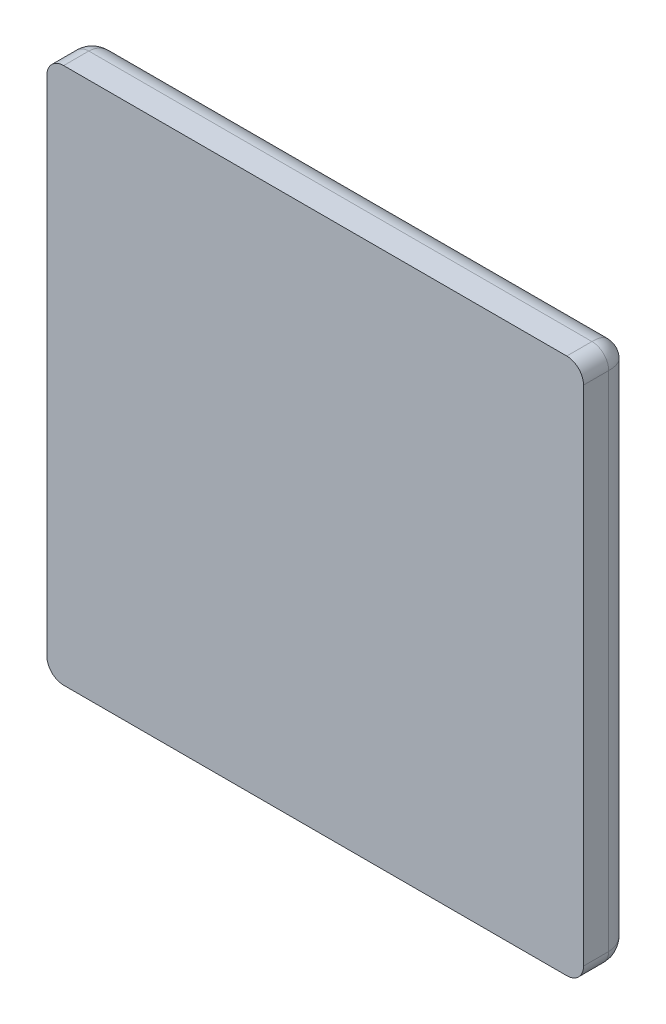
ISO-10303-21;
HEADER;
FILE_DESCRIPTION(('STEP AP214'),'2;1');
FILE_NAME('part.step','',(''),(''),'','','');
FILE_SCHEMA(('AUTOMOTIVE_DESIGN { 1 0 10303 214 1 1 1 1 }'));
ENDSEC;
DATA;
#1=APPLICATION_CONTEXT('core data for automotive mechanical design processes');
#2=APPLICATION_PROTOCOL_DEFINITION('international standard','automotive_design',2000,#1);
#3=PRODUCT_CONTEXT('',#1,'mechanical');
#4=PRODUCT('Part','Part','',(#3));
#5=PRODUCT_RELATED_PRODUCT_CATEGORY('part','',(#4));
#6=PRODUCT_DEFINITION_FORMATION('','',#4);
#7=PRODUCT_DEFINITION_CONTEXT('part definition',#1,'design');
#8=PRODUCT_DEFINITION('design','',#6,#7);
#9=PRODUCT_DEFINITION_SHAPE('','',#8);
#10=(LENGTH_UNIT() NAMED_UNIT(*) SI_UNIT(.MILLI.,.METRE.));
#11=(NAMED_UNIT(*) PLANE_ANGLE_UNIT() SI_UNIT($,.RADIAN.));
#12=(NAMED_UNIT(*) SI_UNIT($,.STERADIAN.) SOLID_ANGLE_UNIT());
#13=UNCERTAINTY_MEASURE_WITH_UNIT(LENGTH_MEASURE(1.E-05),#10,'distance_accuracy_value','');
#14=(GEOMETRIC_REPRESENTATION_CONTEXT(3) GLOBAL_UNCERTAINTY_ASSIGNED_CONTEXT((#13)) GLOBAL_UNIT_ASSIGNED_CONTEXT((#10,
#11,#12)) REPRESENTATION_CONTEXT('',''));
#15=CARTESIAN_POINT('',(0.,0.,0.));
#16=DIRECTION('',(0.,0.,1.));
#17=DIRECTION('',(1.,0.,0.));
#18=AXIS2_PLACEMENT_3D('',#15,#16,#17);
#19=CARTESIAN_POINT('',(8.5,-9.5,1.5));
#20=CARTESIAN_POINT('',(8.64959965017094,-9.5,1.5));
#21=CARTESIAN_POINT('',(8.87382526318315,-9.44864904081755,1.5));
#22=CARTESIAN_POINT('',(9.12869530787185,-9.28832458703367,1.5));
#23=CARTESIAN_POINT('',(9.31506766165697,-9.10215615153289,1.5));
#24=CARTESIAN_POINT('',(9.4618756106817,-8.83656565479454,1.5));
#25=CARTESIAN_POINT('',(9.5,-8.61219973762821,1.5));
#26=CARTESIAN_POINT('',(9.5,-8.5,1.5));
#27=CARTESIAN_POINT('',(8.5,-9.5,1.3878002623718));
#28=CARTESIAN_POINT('',(8.64959965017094,-9.5,1.37658483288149));
#29=CARTESIAN_POINT('',(8.87382526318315,-9.44864904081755,1.36367698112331));
#30=CARTESIAN_POINT('',(9.12869530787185,-9.28832458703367,1.3565996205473));
#31=CARTESIAN_POINT('',(9.31506766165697,-9.10215615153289,1.35658888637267));
#32=CARTESIAN_POINT('',(9.4618756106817,-8.83656565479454,1.36547403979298));
#33=CARTESIAN_POINT('',(9.5,-8.61219973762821,1.37940636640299));
#34=CARTESIAN_POINT('',(9.5,-8.5,1.38780026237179));
#35=CARTESIAN_POINT('',(8.49158650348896,-9.47475951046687,1.16337706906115));
#36=CARTESIAN_POINT('',(8.63516135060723,-9.46930415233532,1.1299187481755));
#37=CARTESIAN_POINT('',(8.85036280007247,-9.41297735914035,1.09141329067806));
#38=CARTESIAN_POINT('',(9.09701167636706,-9.25312402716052,1.07032381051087));
#39=CARTESIAN_POINT('',(9.27925701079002,-9.07104964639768,1.070288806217));
#40=CARTESIAN_POINT('',(9.42670608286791,-8.81459243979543,1.09676856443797));
#41=CARTESIAN_POINT('',(9.47064634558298,-8.59926245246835,1.13832159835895));
#42=CARTESIAN_POINT('',(9.47475951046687,-8.49158650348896,1.16337706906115));
#43=CARTESIAN_POINT('',(8.45427085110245,-9.36281255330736,0.843743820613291));
#44=CARTESIAN_POINT('',(8.57575277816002,-9.33968736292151,0.793195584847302));
#45=CARTESIAN_POINT('',(8.75791879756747,-9.26913659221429,0.73583875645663));
#46=CARTESIAN_POINT('',(8.97313452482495,-9.11451849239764,0.704586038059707));
#47=CARTESIAN_POINT('',(9.13816191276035,-8.94960245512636,0.704544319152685));
#48=CARTESIAN_POINT('',(9.28410005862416,-8.72760788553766,0.743751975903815));
#49=CARTESIAN_POINT('',(9.34550425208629,-8.54539344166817,0.805881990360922));
#50=CARTESIAN_POINT('',(9.36281255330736,-8.45427085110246,0.843743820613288));
#51=CARTESIAN_POINT('',(8.3742557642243,-9.1227672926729,0.46112464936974));
#52=CARTESIAN_POINT('',(8.45970020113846,-9.07870364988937,0.413738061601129));
#53=CARTESIAN_POINT('',(8.58789303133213,-8.99607577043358,0.361381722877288));
#54=CARTESIAN_POINT('',(8.74808104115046,-8.86027726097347,0.333150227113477));
#55=CARTESIAN_POINT('',(8.87900866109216,-8.729387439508,0.333127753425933));
#56=CARTESIAN_POINT('',(9.01129794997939,-8.5665327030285,0.368489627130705));
#57=CARTESIAN_POINT('',(9.08978549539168,-8.43835714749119,0.425601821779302));
#58=CARTESIAN_POINT('',(9.12276729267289,-8.37425576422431,0.461124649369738));
#59=CARTESIAN_POINT('',(8.22438191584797,-8.67314574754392,0.102425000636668));
#60=CARTESIAN_POINT('',(8.26694263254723,-8.630204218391,0.088230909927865));
#61=CARTESIAN_POINT('',(8.33081031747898,-8.56589591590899,0.073244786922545));
#62=CARTESIAN_POINT('',(8.41613789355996,-8.480239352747,0.065312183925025));
#63=CARTESIAN_POINT('',(8.49093508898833,-8.40545388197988,0.065313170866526));
#64=CARTESIAN_POINT('',(8.57662562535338,-8.32016284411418,0.075221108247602));
#65=CARTESIAN_POINT('',(8.64098697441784,-8.25631425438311,0.091766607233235));
#66=CARTESIAN_POINT('',(8.67314574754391,-8.22438191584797,0.102425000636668));
#67=CARTESIAN_POINT('',(8.07479982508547,-8.22439947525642,0.));
#68=CARTESIAN_POINT('',(8.08904741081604,-8.21015188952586,0.));
#69=CARTESIAN_POINT('',(8.11041878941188,-8.18878051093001,0.));
#70=CARTESIAN_POINT('',(8.13891396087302,-8.16028533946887,0.));
#71=CARTESIAN_POINT('',(8.16384723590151,-8.13535206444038,0.));
#72=CARTESIAN_POINT('',(8.19234240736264,-8.10685689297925,0.));
#73=CARTESIAN_POINT('',(8.21371378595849,-8.0854855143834,0.));
#74=CARTESIAN_POINT('',(8.22439947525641,-8.07479982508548,0.));
#75=CARTESIAN_POINT('',(8.,-8.00000000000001,0.));
#76=CARTESIAN_POINT('',(8.,-8.00000000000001,0.));
#77=CARTESIAN_POINT('',(8.,-8.00000000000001,0.));
#78=CARTESIAN_POINT('',(8.,-8.00000000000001,0.));
#79=CARTESIAN_POINT('',(8.,-8.00000000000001,0.));
#80=CARTESIAN_POINT('',(8.,-8.00000000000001,0.));
#81=CARTESIAN_POINT('',(8.,-8.00000000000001,0.));
#82=CARTESIAN_POINT('',(8.,-8.00000000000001,0.));
#83=B_SPLINE_SURFACE_WITH_KNOTS('',3,3,((#19,#20,#21,#22,#23,#24,#25,#26),(#27,#28,#29,#30,#31,
#32,#33,#34),(#35,#36,#37,#38,#39,#40,#41,#42),(#43,#44,#45,#46,#47,#48,#49,#50),(#51,#52,#53,
#54,#55,#56,#57,#58),(#59,#60,#61,#62,#63,#64,#65,#66),(#67,#68,#69,#70,#71,#72,#73,#74),(#75,
#76,#77,#78,#79,#80,#81,#82)),.UNSPECIFIED.,.F.,.F.,.F.,(4,1,1,1,1,4),(4,1,1,1,1,4),(0.,
0.224399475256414,0.448798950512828,0.673198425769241,1.12199737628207,1.5707963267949),(0.,
0.285714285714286,0.428571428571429,0.571428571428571,0.785714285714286,1.),.UNSPECIFIED.);
#84=CARTESIAN_POINT('',(8.,-8.00000000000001,0.));
#85=CARTESIAN_POINT('',(8.22439947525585,-8.07479982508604,0.));
#86=CARTESIAN_POINT('',(8.67314574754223,-8.22438191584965,0.102425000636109));
#87=CARTESIAN_POINT('',(9.12276729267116,-8.37425576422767,0.461124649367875));
#88=CARTESIAN_POINT('',(9.36281255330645,-8.45427085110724,0.843743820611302));
#89=CARTESIAN_POINT('',(9.47475951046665,-8.49158650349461,1.16337706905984));
#90=CARTESIAN_POINT('',(9.5,-8.50000000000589,1.38780026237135));
#91=CARTESIAN_POINT('',(9.5,-8.50000000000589,1.5));
#92=B_SPLINE_CURVE_WITH_KNOTS('',3,(#84,#85,#86,#87,#88,#89,#90,#91),.UNSPECIFIED.,.F.,.F.,(4,1,
1,1,1,4),(0.,0.448798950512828,0.897597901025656,1.12199737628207,1.34639685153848,
1.5707963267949),.UNSPECIFIED.);
#93=CARTESIAN_POINT('',(9.5,-8.5,1.5));
#94=VERTEX_POINT('',#93);
#95=CARTESIAN_POINT('',(8.,-8.,0.));
#96=VERTEX_POINT('',#95);
#97=EDGE_CURVE('E112',#94,#96,#92,.F.);
#98=CARTESIAN_POINT('',(9.5,-8.5,1.5));
#99=CARTESIAN_POINT('',(9.50000000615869,-8.5130898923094,1.5));
#100=CARTESIAN_POINT('',(9.49974054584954,-8.52617966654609,1.5));
#101=CARTESIAN_POINT('',(9.49870609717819,-8.55233882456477,1.5));
#102=CARTESIAN_POINT('',(9.49793110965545,-8.56540820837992,1.5));
#103=CARTESIAN_POINT('',(9.49586900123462,-8.59150660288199,1.5));
#104=CARTESIAN_POINT('',(9.4945818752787,-8.6045356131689,1.5));
#105=CARTESIAN_POINT('',(9.49149888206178,-8.63053336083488,1.5));
#106=CARTESIAN_POINT('',(9.48970301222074,-8.64350209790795,1.5));
#107=CARTESIAN_POINT('',(9.48560590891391,-8.66935937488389,1.5));
#108=CARTESIAN_POINT('',(9.48330467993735,-8.68224791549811,1.5));
#109=CARTESIAN_POINT('',(9.47820024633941,-8.70792488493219,1.5));
#110=CARTESIAN_POINT('',(9.47539705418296,-8.72071331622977,1.5));
#111=CARTESIAN_POINT('',(9.46929202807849,-8.74617013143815,1.5));
#112=CARTESIAN_POINT('',(9.46599021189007,-8.75883851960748,1.5));
#113=CARTESIAN_POINT('',(9.45889147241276,-8.7840353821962,1.5));
#114=CARTESIAN_POINT('',(9.45509456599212,-8.79656386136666,1.5));
#115=CARTESIAN_POINT('',(9.44700844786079,-8.8214607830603,1.5));
#116=CARTESIAN_POINT('',(9.44271924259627,-8.83382922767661,1.5));
#117=CARTESIAN_POINT('',(9.43365465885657,-8.85838694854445,1.5));
#118=CARTESIAN_POINT('',(9.4288792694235,-8.8705762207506,1.5));
#119=CARTESIAN_POINT('',(9.41885287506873,-8.89475808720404,1.5));
#120=CARTESIAN_POINT('',(9.41360185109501,-8.90675067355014,1.5));
#121=CARTESIAN_POINT('',(9.40263385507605,-8.93052136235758,1.5));
#122=CARTESIAN_POINT('',(9.39691686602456,-8.94229945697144,1.5));
#123=CARTESIAN_POINT('',(9.38502683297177,-8.9656234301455,1.5));
#124=CARTESIAN_POINT('',(9.37885378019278,-8.97716930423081,1.5));
#125=CARTESIAN_POINT('',(9.36606144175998,-9.0000110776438,1.5));
#126=CARTESIAN_POINT('',(9.35944215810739,-9.01130697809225,1.5));
#127=CARTESIAN_POINT('',(9.34576720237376,-9.03363105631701,1.5));
#128=CARTESIAN_POINT('',(9.3387115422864,-9.04465924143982,1.5));
#129=CARTESIAN_POINT('',(9.32417364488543,-9.06643011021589,1.5));
#130=CARTESIAN_POINT('',(9.31669142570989,-9.07717280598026,1.5));
#131=CARTESIAN_POINT('',(9.30131033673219,-9.09835502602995,1.5));
#132=CARTESIAN_POINT('',(9.29341148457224,-9.10879456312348,1.5));
#133=CARTESIAN_POINT('',(9.27720664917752,-9.12935240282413,1.5));
#134=CARTESIAN_POINT('',(9.26890067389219,-9.13947071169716,1.5));
#135=CARTESIAN_POINT('',(9.25189595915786,-9.15937193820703,1.5));
#136=CARTESIAN_POINT('',(9.24319721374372,-9.16915485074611,1.5));
#137=CARTESIAN_POINT('',(9.22542194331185,-9.18837180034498,1.5));
#138=CARTESIAN_POINT('',(9.21634540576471,-9.19780582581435,1.5));
#139=CARTESIAN_POINT('',(9.19782934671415,-9.21631134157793,1.5));
#140=CARTESIAN_POINT('',(9.18838981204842,-9.22538281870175,1.5));
#141=CARTESIAN_POINT('',(9.16916261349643,-9.24314963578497,1.5));
#142=CARTESIAN_POINT('',(9.1593749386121,-9.25184496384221,1.5));
#143=CARTESIAN_POINT('',(9.13946623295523,-9.26884579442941,1.5));
#144=CARTESIAN_POINT('',(9.12934519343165,-9.27715128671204,1.5));
#145=CARTESIAN_POINT('',(9.10878486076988,-9.29335897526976,1.5));
#146=CARTESIAN_POINT('',(9.09834556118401,-9.30126116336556,1.5));
#147=CARTESIAN_POINT('',(9.077165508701,-9.31665060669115,1.5));
#148=CARTESIAN_POINT('',(9.06642475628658,-9.32413786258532,1.5));
#149=CARTESIAN_POINT('',(9.0446584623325,-9.33868562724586,1.5));
#150=CARTESIAN_POINT('',(9.03363292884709,-9.34574614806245,1.5));
#151=CARTESIAN_POINT('',(9.01131375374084,-9.35942861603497,1.5));
#152=CARTESIAN_POINT('',(9.00002012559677,-9.36605058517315,1.5));
#153=CARTESIAN_POINT('',(8.97718153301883,-9.37884431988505,1.5));
#154=CARTESIAN_POINT('',(8.96563658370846,-9.38501611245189,1.5));
#155=CARTESIAN_POINT('',(8.94231174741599,-9.39689710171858,1.5));
#156=CARTESIAN_POINT('',(8.93053187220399,-9.40260632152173,1.5));
#157=CARTESIAN_POINT('',(8.90675517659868,-9.41355322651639,1.5));
#158=CARTESIAN_POINT('',(8.89475835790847,-9.41879091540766,1.5));
#159=CARTESIAN_POINT('',(8.87056768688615,-9.42879065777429,1.5));
#160=CARTESIAN_POINT('',(8.8583738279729,-9.43355269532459,1.5));
#161=CARTESIAN_POINT('',(8.83380851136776,-9.44259612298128,1.5));
#162=CARTESIAN_POINT('',(8.821437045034,-9.44687748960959,1.5));
#163=CARTESIAN_POINT('',(8.79653606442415,-9.45495479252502,1.5));
#164=CARTESIAN_POINT('',(8.78400654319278,-9.45875070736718,1.5));
#165=CARTESIAN_POINT('',(8.75880896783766,-9.4658522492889,1.5));
#166=CARTESIAN_POINT('',(8.74614091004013,-9.46915786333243,1.5));
#167=CARTESIAN_POINT('',(8.72068578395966,-9.47527395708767,1.5));
#168=CARTESIAN_POINT('',(8.70789871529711,-9.47808443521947,1.5));
#169=CARTESIAN_POINT('',(8.68222508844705,-9.48320540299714,1.5));
#170=CARTESIAN_POINT('',(8.66933853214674,-9.48551590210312,1.5));
#171=CARTESIAN_POINT('',(8.64348545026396,-9.48963205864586,1.5));
#172=CARTESIAN_POINT('',(8.63051892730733,-9.49143773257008,1.5));
#173=CARTESIAN_POINT('',(8.60452544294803,-9.49453939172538,1.5));
#174=CARTESIAN_POINT('',(8.59149848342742,-9.49583539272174,1.5));
#175=CARTESIAN_POINT('',(8.56540362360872,-9.49791285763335,1.5));
#176=CARTESIAN_POINT('',(8.55233572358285,-9.49869432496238,1.5));
#177=CARTESIAN_POINT('',(8.52617860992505,-9.49973792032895,1.5));
#178=CARTESIAN_POINT('',(8.51308939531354,-9.50000002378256,1.5));
#179=CARTESIAN_POINT('',(8.5,-9.5,1.5));
#180=B_SPLINE_CURVE_WITH_KNOTS('',3,(#98,#99,#100,#101,#102,#103,#104,#105,#106,#107,#108,#109,
#110,#111,#112,#113,#114,#115,#116,#117,#118,#119,#120,#121,#122,#123,#124,#125,#126,#127,#128,
#129,#130,#131,#132,#133,#134,#135,#136,#137,#138,#139,#140,#141,#142,#143,#144,#145,#146,#147,
#148,#149,#150,#151,#152,#153,#154,#155,#156,#157,#158,#159,#160,#161,#162,#163,#164,#165,#166,
#167,#168,#169,#170,#171,#172,#173,#174,#175,#176,#177,#178,#179),.UNSPECIFIED.,.F.,.F.,(4,2,2,
2,2,2,2,2,2,2,2,2,2,2,2,2,2,2,2,2,2,2,2,2,2,2,2,2,2,2,2,2,2,2,2,2,2,2,2,2,4),(0.,
0.0392669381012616,0.0785338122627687,0.117801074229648,0.157068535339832,0.196335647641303,
0.235601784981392,0.274866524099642,0.314129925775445,0.353392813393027,0.392656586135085,
0.431921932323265,0.471188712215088,0.510456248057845,0.549723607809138,0.588989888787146,
0.628254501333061,0.667517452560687,0.706779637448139,0.746042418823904,0.785306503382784,
0.82457201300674,0.863838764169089,0.903106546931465,0.942375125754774,0.981643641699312,
1.02091104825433,1.06017648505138,1.09943956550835,1.13870068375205,1.17796149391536,
1.21722361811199,1.25648765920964,1.2957534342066,1.33502025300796,1.37428719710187,
1.41355339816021,1.45281831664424,1.49208202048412,1.53134546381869,1.57061076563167),.UNSPECIFIED.);
#181=CARTESIAN_POINT('',(8.5,-9.5,1.5));
#182=VERTEX_POINT('',#181);
#183=EDGE_CURVE('E95',#94,#182,#180,.T.);
#184=CARTESIAN_POINT('',(8.5,-9.5,1.5));
#185=CARTESIAN_POINT('',(8.50000002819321,-9.50000008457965,1.48036408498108));
#186=CARTESIAN_POINT('',(8.49987115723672,-9.49961347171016,1.46072828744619));
#187=CARTESIAN_POINT('',(8.49935677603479,-9.49807032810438,1.42148645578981));
#188=CARTESIAN_POINT('',(8.49897121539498,-9.49691364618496,1.40188042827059));
#189=CARTESIAN_POINT('',(8.49794443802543,-9.49383331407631,1.36272866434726));
#190=CARTESIAN_POINT('',(8.4973031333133,-9.4919093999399,1.34318295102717));
#191=CARTESIAN_POINT('',(8.49576587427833,-9.487297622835,1.30418226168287));
#192=CARTESIAN_POINT('',(8.49486979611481,-9.48460938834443,1.28472733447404));
#193=CARTESIAN_POINT('',(8.49282403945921,-9.47847211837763,1.24593863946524));
#194=CARTESIAN_POINT('',(8.49167420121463,-9.4750226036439,1.22660495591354));
#195=CARTESIAN_POINT('',(8.48912176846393,-9.4673653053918,1.18808929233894));
#196=CARTESIAN_POINT('',(8.4877189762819,-9.46315692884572,1.16890744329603));
#197=CARTESIAN_POINT('',(8.4846623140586,-9.4539869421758,1.13072534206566));
#198=CARTESIAN_POINT('',(8.48300820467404,-9.44902461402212,1.11172528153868));
#199=CARTESIAN_POINT('',(8.47945279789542,-9.43835839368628,1.07393452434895));
#200=CARTESIAN_POINT('',(8.47755122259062,-9.43265366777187,1.05514408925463));
#201=CARTESIAN_POINT('',(8.4735044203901,-9.42051326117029,1.01780051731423));
#202=CARTESIAN_POINT('',(8.47135888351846,-9.41407665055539,0.999247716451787));
#203=CARTESIAN_POINT('',(8.4668277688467,-9.40048330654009,0.962407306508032));
#204=CARTESIAN_POINT('',(8.46444185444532,-9.39332556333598,0.944120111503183));
#205=CARTESIAN_POINT('',(8.45943360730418,-9.37830082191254,0.907838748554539));
#206=CARTESIAN_POINT('',(8.45681091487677,-9.37043274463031,0.889845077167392));
#207=CARTESIAN_POINT('',(8.45133258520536,-9.35399775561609,0.854178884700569));
#208=CARTESIAN_POINT('',(8.44847656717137,-9.34542970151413,0.836506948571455));
#209=CARTESIAN_POINT('',(8.44253596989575,-9.32760790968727,0.801511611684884));
#210=CARTESIAN_POINT('',(8.4394509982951,-9.3183529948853,0.7841888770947));
#211=CARTESIAN_POINT('',(8.43305751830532,-9.29917255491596,0.749918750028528));
#212=CARTESIAN_POINT('',(8.42974861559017,-9.2892458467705,0.732972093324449));
#213=CARTESIAN_POINT('',(8.4229121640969,-9.26873649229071,0.69948115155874));
#214=CARTESIAN_POINT('',(8.41938422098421,-9.25815266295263,0.682937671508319));
#215=CARTESIAN_POINT('',(8.41211459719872,-9.23634379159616,0.650280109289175));
#216=CARTESIAN_POINT('',(8.4083725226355,-9.22511756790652,0.634166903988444));
#217=CARTESIAN_POINT('',(8.40067959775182,-9.20203879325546,0.602396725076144));
#218=CARTESIAN_POINT('',(8.39672835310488,-9.19018505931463,0.58674070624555));
#219=CARTESIAN_POINT('',(8.38862181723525,-9.16586545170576,0.555912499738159));
#220=CARTESIAN_POINT('',(8.38446612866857,-9.15339838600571,0.540741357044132));
#221=CARTESIAN_POINT('',(8.37595828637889,-9.12787485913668,0.510902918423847));
#222=CARTESIAN_POINT('',(8.37160573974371,-9.11481721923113,0.496236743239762));
#223=CARTESIAN_POINT('',(8.36271211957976,-9.08813635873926,0.467426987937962));
#224=CARTESIAN_POINT('',(8.35817066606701,-9.07451199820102,0.453284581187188));
#225=CARTESIAN_POINT('',(8.34890706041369,-9.04672118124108,0.425541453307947));
#226=CARTESIAN_POINT('',(8.34418454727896,-9.03255364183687,0.41194193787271));
#227=CARTESIAN_POINT('',(8.33456667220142,-9.00370001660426,0.385303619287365));
#228=CARTESIAN_POINT('',(8.32967097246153,-8.9890129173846,0.372266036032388));
#229=CARTESIAN_POINT('',(8.31971456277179,-8.95914368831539,0.346770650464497));
#230=CARTESIAN_POINT('',(8.31465354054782,-8.94396062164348,0.334314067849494));
#231=CARTESIAN_POINT('',(8.30437432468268,-8.91312297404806,0.309999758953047));
#232=CARTESIAN_POINT('',(8.29915584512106,-8.89746753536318,0.298143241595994));
#233=CARTESIAN_POINT('',(8.28856955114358,-8.86570865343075,0.275048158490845));
#234=CARTESIAN_POINT('',(8.28320147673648,-8.84960443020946,0.263810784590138));
#235=CARTESIAN_POINT('',(8.27232383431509,-8.81697150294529,0.241973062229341));
#236=CARTESIAN_POINT('',(8.26681403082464,-8.80044209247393,0.231373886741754));
#237=CARTESIAN_POINT('',(8.25566075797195,-8.76698227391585,0.210831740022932));
#238=CARTESIAN_POINT('',(8.2500170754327,-8.75005122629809,0.200889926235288));
#239=CARTESIAN_POINT('',(8.23860393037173,-8.71581179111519,0.181681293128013));
#240=CARTESIAN_POINT('',(8.23283427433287,-8.69850282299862,0.172415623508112));
#241=CARTESIAN_POINT('',(8.22117686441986,-8.66353059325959,0.154579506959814));
#242=CARTESIAN_POINT('',(8.21528893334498,-8.64586680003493,0.146010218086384));
#243=CARTESIAN_POINT('',(8.20340375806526,-8.61021127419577,0.129580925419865));
#244=CARTESIAN_POINT('',(8.19740635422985,-8.59221906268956,0.121722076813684));
#245=CARTESIAN_POINT('',(8.18531233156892,-8.55593699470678,0.106719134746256));
#246=CARTESIAN_POINT('',(8.17921557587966,-8.537646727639,0.0995761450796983));
#247=CARTESIAN_POINT('',(8.16693269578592,-8.50079808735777,0.0860121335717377));
#248=CARTESIAN_POINT('',(8.16074645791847,-8.48223937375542,0.0795921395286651));
#249=CARTESIAN_POINT('',(8.14829452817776,-8.44488358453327,0.0674809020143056));
#250=CARTESIAN_POINT('',(8.14202874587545,-8.42608623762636,0.0617905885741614));
#251=CARTESIAN_POINT('',(8.12942762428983,-8.38828287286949,0.0511456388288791));
#252=CARTESIAN_POINT('',(8.12309221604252,-8.36927664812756,0.0461918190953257));
#253=CARTESIAN_POINT('',(8.11036174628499,-8.33108523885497,0.0370267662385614));
#254=CARTESIAN_POINT('',(8.10396663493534,-8.31189990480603,0.032816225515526));
#255=CARTESIAN_POINT('',(8.09112666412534,-8.27337999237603,0.0251446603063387));
#256=CARTESIAN_POINT('',(8.08468177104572,-8.25404531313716,0.021684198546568));
#257=CARTESIAN_POINT('',(8.0717521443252,-8.21525643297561,0.0155197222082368));
#258=CARTESIAN_POINT('',(8.06526739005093,-8.19580217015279,0.0128161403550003));
#259=CARTESIAN_POINT('',(8.05226795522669,-8.15680386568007,0.00817236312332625));
#260=CARTESIAN_POINT('',(8.04575326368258,-8.13725979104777,0.00623247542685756));
#261=CARTESIAN_POINT('',(8.0327038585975,-8.09811157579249,0.00312299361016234));
#262=CARTESIAN_POINT('',(8.02616914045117,-8.0785074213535,0.00195359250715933));
#263=CARTESIAN_POINT('',(8.01308963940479,-8.03926891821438,0.000392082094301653));
#264=CARTESIAN_POINT('',(8.0065448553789,-8.01963456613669,6.71925660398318E-08));
#265=CARTESIAN_POINT('',(8.,-8.00000000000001,0.));
#266=B_SPLINE_CURVE_WITH_KNOTS('',3,(#184,#185,#186,#187,#188,#189,#190,#191,#192,#193,#194,
#195,#196,#197,#198,#199,#200,#201,#202,#203,#204,#205,#206,#207,#208,#209,#210,#211,#212,#213,
#214,#215,#216,#217,#218,#219,#220,#221,#222,#223,#224,#225,#226,#227,#228,#229,#230,#231,#232,
#233,#234,#235,#236,#237,#238,#239,#240,#241,#242,#243,#244,#245,#246,#247,#248,#249,#250,#251,
#252,#253,#254,#255,#256,#257,#258,#259,#260,#261,#262,#263,#264,#265),.UNSPECIFIED.,.F.,.F.,(4,
2,2,2,2,2,2,2,2,2,2,2,2,2,2,2,2,2,2,2,2,2,2,2,2,2,2,2,2,2,2,2,2,2,2,2,2,2,2,2,4),(0.,
0.0589033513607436,0.117818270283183,0.176753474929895,0.235717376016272,0.294718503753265,
0.353765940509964,0.412869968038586,0.472040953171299,0.531287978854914,0.590619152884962,
0.650042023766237,0.709563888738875,0.769190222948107,0.828924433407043,0.88876948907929,
0.948728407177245,1.00880469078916,1.06900274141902,1.12932675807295,1.18977861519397,
1.25035800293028,1.31106288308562,1.37188993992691,1.43283502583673,1.49389360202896,
1.55506117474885,1.61633372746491,1.67770814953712,1.73918263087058,1.80075533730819,
1.86242156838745,1.92417438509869,1.98600514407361,2.04790395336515,2.10986012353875,
2.17186261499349,2.23390048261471,2.29596331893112,2.3580416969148,2.4201276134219),.UNSPECIFIED.);
#267=EDGE_CURVE('E116',#96,#182,#266,.F.);
#268=ORIENTED_EDGE('',*,*,#97,.F.);
#269=ORIENTED_EDGE('',*,*,#183,.T.);
#270=ORIENTED_EDGE('',*,*,#267,.F.);
#271=EDGE_LOOP('',(#268,#269,#270));
#272=FACE_BOUND('',#271,.T.);
#273=ADVANCED_FACE('F15',(#272),#83,.T.);
#274=CARTESIAN_POINT('',(9.5,21.5,1.5));
#275=CARTESIAN_POINT('',(9.5,21.6495996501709,1.5));
#276=CARTESIAN_POINT('',(9.44864553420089,21.8738214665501,1.5));
#277=CARTESIAN_POINT('',(9.28832748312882,22.1287026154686,1.5));
#278=CARTESIAN_POINT('',(9.10215322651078,22.3150646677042,1.5));
#279=CARTESIAN_POINT('',(8.83656581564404,22.4618772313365,1.5));
#280=CARTESIAN_POINT('',(8.61219973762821,22.5,1.5));
#281=CARTESIAN_POINT('',(8.50000000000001,22.5,1.5));
#282=CARTESIAN_POINT('',(9.5,21.5,1.3878002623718));
#283=CARTESIAN_POINT('',(9.5,21.6495996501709,1.3765841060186));
#284=CARTESIAN_POINT('',(9.44864553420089,21.8738214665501,1.36367785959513));
#285=CARTESIAN_POINT('',(9.28832748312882,22.1287026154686,1.35659921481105));
#286=CARTESIAN_POINT('',(9.10215322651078,22.3150646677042,1.3565890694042));
#287=CARTESIAN_POINT('',(8.83656581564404,22.4618772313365,1.36547389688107));
#288=CARTESIAN_POINT('',(8.61219973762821,22.5,1.37940644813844));
#289=CARTESIAN_POINT('',(8.50000000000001,22.5,1.38780026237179));
#290=CARTESIAN_POINT('',(9.47476072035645,21.4915869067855,1.163380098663));
#291=CARTESIAN_POINT('',(9.46929669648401,21.6351581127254,1.12990891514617));
#292=CARTESIAN_POINT('',(9.4129652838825,21.8503523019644,1.09140918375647));
#293=CARTESIAN_POINT('',(9.25311469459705,22.0970070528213,1.07031256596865));
#294=CARTESIAN_POINT('',(9.07103700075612,22.2792434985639,1.07028071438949));
#295=CARTESIAN_POINT('',(8.81458595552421,22.4266996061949,1.09676198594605));
#296=CARTESIAN_POINT('',(8.59926085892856,22.4706437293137,1.13832083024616));
#297=CARTESIAN_POINT('',(8.49158690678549,22.4747607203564,1.163380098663));
#298=CARTESIAN_POINT('',(9.36281472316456,21.4542715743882,0.843748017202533));
#299=CARTESIAN_POINT('',(9.33967416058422,21.5757474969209,0.793183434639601));
#300=CARTESIAN_POINT('',(9.2691248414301,21.7579074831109,0.735831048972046));
#301=CARTESIAN_POINT('',(9.1145041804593,21.9731253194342,0.704568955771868));
#302=CARTESIAN_POINT('',(8.94958719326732,22.1381455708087,0.704530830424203));
#303=CARTESIAN_POINT('',(8.72759901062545,22.28409095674,0.743741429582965));
#304=CARTESIAN_POINT('',(8.54539176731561,22.3455013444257,0.805880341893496));
#305=CARTESIAN_POINT('',(8.45427157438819,22.3628147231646,0.843748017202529));
#306=CARTESIAN_POINT('',(9.12276814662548,21.3742560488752,0.461132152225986));
#307=CARTESIAN_POINT('',(9.07868564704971,21.4596938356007,0.413727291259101));
#308=CARTESIAN_POINT('',(8.99606753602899,21.5878836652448,0.361368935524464));
#309=CARTESIAN_POINT('',(8.86026237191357,21.7480706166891,0.333128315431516));
#310=CARTESIAN_POINT('',(8.72937415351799,21.8789945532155,0.333108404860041));
#311=CARTESIAN_POINT('',(8.56652382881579,22.0112894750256,0.368476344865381));
#312=CARTESIAN_POINT('',(8.43835563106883,22.0897821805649,0.425600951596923));
#313=CARTESIAN_POINT('',(8.37425604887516,22.1227681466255,0.461132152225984));
#314=CARTESIAN_POINT('',(8.67314741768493,21.2243824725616,0.102440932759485));
#315=CARTESIAN_POINT('',(8.63018395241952,21.2669351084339,0.088227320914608));
#316=CARTESIAN_POINT('',(8.56588323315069,21.3307975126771,0.073227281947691));
#317=CARTESIAN_POINT('',(8.48021816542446,21.4161207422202,0.065286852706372));
#318=CARTESIAN_POINT('',(8.40543559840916,21.4909156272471,0.065288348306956));
#319=CARTESIAN_POINT('',(8.32015056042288,21.5766129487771,0.075205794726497));
#320=CARTESIAN_POINT('',(8.25631179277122,21.6409824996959,0.091769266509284));
#321=CARTESIAN_POINT('',(8.22438247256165,21.6731474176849,0.102440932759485));
#322=CARTESIAN_POINT('',(8.22439947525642,21.0747998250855,0.));
#323=CARTESIAN_POINT('',(8.21015188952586,21.089047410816,0.));
#324=CARTESIAN_POINT('',(8.18878051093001,21.1104187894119,0.));
#325=CARTESIAN_POINT('',(8.16028533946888,21.138913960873,0.));
#326=CARTESIAN_POINT('',(8.13535206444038,21.1638472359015,0.));
#327=CARTESIAN_POINT('',(8.10685689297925,21.1923424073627,0.));
#328=CARTESIAN_POINT('',(8.0854855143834,21.2137137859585,0.));
#329=CARTESIAN_POINT('',(8.07479982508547,21.2243994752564,0.));
#330=CARTESIAN_POINT('',(8.,21.,0.));
#331=CARTESIAN_POINT('',(8.,21.,0.));
#332=CARTESIAN_POINT('',(8.,21.,0.));
#333=CARTESIAN_POINT('',(8.00000000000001,21.,0.));
#334=CARTESIAN_POINT('',(8.,21.,0.));
#335=CARTESIAN_POINT('',(8.00000000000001,21.,0.));
#336=CARTESIAN_POINT('',(8.,21.,0.));
#337=CARTESIAN_POINT('',(8.,21.,0.));
#338=B_SPLINE_SURFACE_WITH_KNOTS('',3,3,((#274,#275,#276,#277,#278,#279,#280,#281),(#282,#283,
#284,#285,#286,#287,#288,#289),(#290,#291,#292,#293,#294,#295,#296,#297),(#298,#299,#300,#301,
#302,#303,#304,#305),(#306,#307,#308,#309,#310,#311,#312,#313),(#314,#315,#316,#317,#318,#319,
#320,#321),(#322,#323,#324,#325,#326,#327,#328,#329),(#330,#331,#332,#333,#334,#335,#336,#337)),
.UNSPECIFIED.,.F.,.F.,.F.,(4,1,1,1,1,4),(4,1,1,1,1,4),(0.,0.224399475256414,0.448798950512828,
0.673198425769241,1.12199737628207,1.5707963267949),(0.,0.285714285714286,0.428571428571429,
0.571428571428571,0.785714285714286,1.),.UNSPECIFIED.);
#339=CARTESIAN_POINT('',(8.,21.,0.));
#340=CARTESIAN_POINT('',(8.07479982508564,21.2243994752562,0.));
#341=CARTESIAN_POINT('',(8.22438247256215,21.6731474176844,0.102440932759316));
#342=CARTESIAN_POINT('',(8.37425604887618,22.1227681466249,0.461132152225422));
#343=CARTESIAN_POINT('',(8.45427157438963,22.3628147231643,0.84374801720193));
#344=CARTESIAN_POINT('',(8.4915869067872,22.4747607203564,1.1633800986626));
#345=CARTESIAN_POINT('',(8.50000000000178,22.5,1.38780026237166));
#346=CARTESIAN_POINT('',(8.50000000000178,22.5,1.5));
#347=B_SPLINE_CURVE_WITH_KNOTS('',3,(#339,#340,#341,#342,#343,#344,#345,#346),.UNSPECIFIED.,.F.,
.F.,(4,1,1,1,1,4),(0.,0.448798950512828,0.897597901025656,1.12199737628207,1.34639685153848,
1.5707963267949),.UNSPECIFIED.);
#348=CARTESIAN_POINT('',(8.5,22.5,1.5));
#349=VERTEX_POINT('',#348);
#350=CARTESIAN_POINT('',(8.,21.,0.));
#351=VERTEX_POINT('',#350);
#352=EDGE_CURVE('E231',#349,#351,#347,.F.);
#353=CARTESIAN_POINT('',(8.50000000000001,22.5,1.5));
#354=CARTESIAN_POINT('',(8.61219973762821,22.5,1.5));
#355=CARTESIAN_POINT('',(8.83656581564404,22.4618772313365,1.5));
#356=CARTESIAN_POINT('',(9.10215322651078,22.3150646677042,1.5));
#357=CARTESIAN_POINT('',(9.28832748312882,22.1287026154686,1.5));
#358=CARTESIAN_POINT('',(9.44864553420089,21.8738214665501,1.5));
#359=CARTESIAN_POINT('',(9.5,21.6495996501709,1.5));
#360=CARTESIAN_POINT('',(9.5,21.5,1.5));
#361=B_SPLINE_CURVE_WITH_KNOTS('',3,(#353,#354,#355,#356,#357,#358,#359,#360),.UNSPECIFIED.,.F.,
.F.,(4,1,1,1,1,4),(0.,0.214285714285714,0.428571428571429,0.571428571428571,0.714285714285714,
1.),.UNSPECIFIED.);
#362=CARTESIAN_POINT('',(9.5,21.5,1.5));
#363=VERTEX_POINT('',#362);
#364=EDGE_CURVE('E108',#349,#363,#361,.T.);
#365=CARTESIAN_POINT('',(9.5,21.5,1.5));
#366=CARTESIAN_POINT('',(9.50000008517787,21.5000000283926,1.48036412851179));
#367=CARTESIAN_POINT('',(9.49961349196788,21.4998711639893,1.46072837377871));
#368=CARTESIAN_POINT('',(9.49807041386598,21.499356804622,1.42148669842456));
#369=CARTESIAN_POINT('',(9.49691378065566,21.4989712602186,1.40188078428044));
#370=CARTESIAN_POINT('',(9.49383356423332,21.4979445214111,1.36272929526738));
#371=CARTESIAN_POINT('',(9.49190971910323,21.4973032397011,1.34318374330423));
#372=CARTESIAN_POINT('',(9.48729809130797,21.495766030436,1.30418340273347));
#373=CARTESIAN_POINT('',(9.48460993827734,21.4948699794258,1.28472866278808));
#374=CARTESIAN_POINT('',(9.47847283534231,21.4928242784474,1.24594034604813));
#375=CARTESIAN_POINT('',(9.47502340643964,21.4916744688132,1.22660685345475));
#376=CARTESIAN_POINT('',(9.4673662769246,21.4891220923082,1.18809155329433));
#377=CARTESIAN_POINT('',(9.46315798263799,21.487719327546,1.1689098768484));
#378=CARTESIAN_POINT('',(9.45398815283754,21.4846627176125,1.13072809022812));
#379=CARTESIAN_POINT('',(9.44902589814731,21.4830086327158,1.11172817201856));
#380=CARTESIAN_POINT('',(9.43835981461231,21.4794532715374,1.0739376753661));
#381=CARTESIAN_POINT('',(9.43265515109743,21.4775517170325,1.05514735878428));
#382=CARTESIAN_POINT('',(9.42051485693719,21.4735049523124,1.01780400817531));
#383=CARTESIAN_POINT('',(9.41407829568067,21.4713594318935,0.999251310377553));
#384=CARTESIAN_POINT('',(9.40048503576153,21.4668283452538,0.962411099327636));
#385=CARTESIAN_POINT('',(9.39332732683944,21.4644424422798,0.944124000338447));
#386=CARTESIAN_POINT('',(9.37830263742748,21.4594342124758,0.907842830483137));
#387=CARTESIAN_POINT('',(9.37043457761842,21.4568115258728,0.889849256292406));
#388=CARTESIAN_POINT('',(9.35399960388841,21.4513332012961,0.854183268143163));
#389=CARTESIAN_POINT('',(9.34543154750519,21.4484771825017,0.836511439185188));
#390=CARTESIAN_POINT('',(9.32760973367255,21.4425365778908,0.801516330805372));
#391=CARTESIAN_POINT('',(9.31835479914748,21.4394515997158,0.784193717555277));
#392=CARTESIAN_POINT('',(9.29917430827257,21.4330581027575,0.74992384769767));
#393=CARTESIAN_POINT('',(9.2892475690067,21.4297491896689,0.732977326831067));
#394=CARTESIAN_POINT('',(9.26873814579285,21.4229127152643,0.699486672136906));
#395=CARTESIAN_POINT('',(9.25815427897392,21.419384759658,0.682943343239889));
#396=CARTESIAN_POINT('',(9.2363453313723,21.4121151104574,0.650286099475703));
#397=CARTESIAN_POINT('',(9.22511906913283,21.4083730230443,0.634173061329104));
#398=CARTESIAN_POINT('',(9.20204022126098,21.4006800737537,0.602403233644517));
#399=CARTESIAN_POINT('',(9.19018645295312,21.396728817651,0.586747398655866));
#400=CARTESIAN_POINT('',(9.16586678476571,21.3886222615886,0.555919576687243));
#401=CARTESIAN_POINT('',(9.15339969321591,21.3844665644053,0.540748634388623));
#402=CARTESIAN_POINT('',(9.12787612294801,21.3759587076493,0.510910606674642));
#403=CARTESIAN_POINT('',(9.11481846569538,21.3716061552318,0.496244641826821));
#404=CARTESIAN_POINT('',(9.08813757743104,21.3627125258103,0.467435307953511));
#405=CARTESIAN_POINT('',(9.07451320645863,21.3581710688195,0.453293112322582));
#406=CARTESIAN_POINT('',(9.04672237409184,21.3489074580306,0.42555039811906));
#407=CARTESIAN_POINT('',(9.03255482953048,21.3441849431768,0.411951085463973));
#408=CARTESIAN_POINT('',(9.00370119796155,21.3345670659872,0.385313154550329));
#409=CARTESIAN_POINT('',(8.98901409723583,21.3296713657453,0.372275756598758));
#410=CARTESIAN_POINT('',(8.95914486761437,21.3197149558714,0.346780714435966));
#411=CARTESIAN_POINT('',(8.94396180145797,21.3146539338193,0.334324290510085));
#412=CARTESIAN_POINT('',(8.91312415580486,21.3043747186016,0.310010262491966));
#413=CARTESIAN_POINT('',(8.89746871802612,21.299156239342,0.298153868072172));
#414=CARTESIAN_POINT('',(8.86570983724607,21.2885699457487,0.275058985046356));
#415=CARTESIAN_POINT('',(8.8496056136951,21.2832018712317,0.263821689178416));
#416=CARTESIAN_POINT('',(8.81697268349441,21.2723242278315,0.241984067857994));
#417=CARTESIAN_POINT('',(8.80044326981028,21.2668144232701,0.231384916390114));
#418=CARTESIAN_POINT('',(8.76698344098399,21.2556611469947,0.21084275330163));
#419=CARTESIAN_POINT('',(8.75005238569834,21.2500174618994,0.200900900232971));
#420=CARTESIAN_POINT('',(8.71581292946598,21.238604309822,0.181692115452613));
#421=CARTESIAN_POINT('',(8.69850394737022,21.2328346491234,0.172426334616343));
#422=CARTESIAN_POINT('',(8.66353168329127,21.2211772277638,0.154589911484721));
#423=CARTESIAN_POINT('',(8.64586786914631,21.2152892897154,0.146020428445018));
#424=CARTESIAN_POINT('',(8.61021229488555,21.2034040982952,0.129590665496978));
#425=CARTESIAN_POINT('',(8.59222005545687,21.1974066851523,0.121731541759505));
#426=CARTESIAN_POINT('',(8.55593792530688,21.1853126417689,0.106727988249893));
#427=CARTESIAN_POINT('',(8.53764762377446,21.1792158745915,0.0995846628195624));
#428=CARTESIAN_POINT('',(8.50079891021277,21.1669329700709,0.0860199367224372));
#429=CARTESIAN_POINT('',(8.48224015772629,21.1607467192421,0.0795995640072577));
#430=CARTESIAN_POINT('',(8.44488428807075,21.1482947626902,0.0674875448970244));
#431=CARTESIAN_POINT('',(8.42608689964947,21.1420289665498,0.0617968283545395));
#432=CARTESIAN_POINT('',(8.38828345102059,21.1294278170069,0.0511510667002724));
#433=CARTESIAN_POINT('',(8.36927718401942,21.1230923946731,0.0461968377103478));
#434=CARTESIAN_POINT('',(8.33108569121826,21.1103618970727,0.0370309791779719));
#435=CARTESIAN_POINT('',(8.31190031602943,21.1039667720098,0.0328200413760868));
#436=CARTESIAN_POINT('',(8.27338032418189,21.0911267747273,0.0251477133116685));
#437=CARTESIAN_POINT('',(8.2540456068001,21.0846818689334,0.0216868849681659));
#438=CARTESIAN_POINT('',(8.21525665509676,21.0717522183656,0.0155217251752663));
#439=CARTESIAN_POINT('',(8.19580235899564,21.0652674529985,0.0128178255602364));
#440=CARTESIAN_POINT('',(8.15680399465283,21.0522679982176,0.00817348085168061));
#441=CARTESIAN_POINT('',(8.13725989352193,21.0457532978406,0.00623334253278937));
#442=CARTESIAN_POINT('',(8.09811163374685,21.0327038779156,0.00312344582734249));
#443=CARTESIAN_POINT('',(8.07850746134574,21.0261691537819,0.0019538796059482));
#444=CARTESIAN_POINT('',(8.03926893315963,21.0130896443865,0.000392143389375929));
#445=CARTESIAN_POINT('',(8.01963457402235,21.0065448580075,6.70825922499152E-08));
#446=CARTESIAN_POINT('',(8.,21.,0.));
#447=B_SPLINE_CURVE_WITH_KNOTS('',3,(#365,#366,#367,#368,#369,#370,#371,#372,#373,#374,#375,
#376,#377,#378,#379,#380,#381,#382,#383,#384,#385,#386,#387,#388,#389,#390,#391,#392,#393,#394,
#395,#396,#397,#398,#399,#400,#401,#402,#403,#404,#405,#406,#407,#408,#409,#410,#411,#412,#413,
#414,#415,#416,#417,#418,#419,#420,#421,#422,#423,#424,#425,#426,#427,#428,#429,#430,#431,#432,
#433,#434,#435,#436,#437,#438,#439,#440,#441,#442,#443,#444,#445,#446),.UNSPECIFIED.,.F.,.F.,(4,
2,2,2,2,2,2,2,2,2,2,2,2,2,2,2,2,2,2,2,2,2,2,2,2,2,2,2,2,2,2,2,2,2,2,2,2,2,2,2,4),(0.,
0.0589032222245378,0.117817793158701,0.176752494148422,0.235715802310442,0.294716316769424,
0.353763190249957,0.412866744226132,0.472037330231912,0.531284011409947,0.590614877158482,
0.650037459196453,0.709559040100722,0.769185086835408,0.828919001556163,0.888763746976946,
0.948722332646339,1.00879825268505,1.06899590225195,1.12931949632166,1.18977093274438,
1.25034992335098,1.3110544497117,1.37188121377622,1.43282608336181,1.49388453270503,
1.55505207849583,1.61632471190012,1.67769932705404,1.73917411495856,1.80074722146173,
1.86241390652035,1.92416719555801,1.98599841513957,2.04789764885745,2.10985418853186,
2.17185698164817,2.23389507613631,2.29595806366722,2.35803652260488,2.42012246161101),.UNSPECIFIED.);
#448=EDGE_CURVE('E123',#351,#363,#447,.F.);
#449=ORIENTED_EDGE('',*,*,#352,.F.);
#450=ORIENTED_EDGE('',*,*,#364,.T.);
#451=ORIENTED_EDGE('',*,*,#448,.F.);
#452=EDGE_LOOP('',(#449,#450,#451));
#453=FACE_BOUND('',#452,.T.);
#454=ADVANCED_FACE('F331',(#453),#338,.T.);
#455=CARTESIAN_POINT('',(-21.5,22.5,1.5));
#456=CARTESIAN_POINT('',(-21.6495996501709,22.5,1.5));
#457=CARTESIAN_POINT('',(-21.8738200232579,22.4486419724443,1.5));
#458=CARTESIAN_POINT('',(-22.1287012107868,22.2883243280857,1.5));
#459=CARTESIAN_POINT('',(-22.3150634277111,22.1021506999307,1.5));
#460=CARTESIAN_POINT('',(-22.461876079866,21.8365639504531,1.5));
#461=CARTESIAN_POINT('',(-22.5,21.6121997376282,1.5));
#462=CARTESIAN_POINT('',(-22.5,21.5,1.5));
#463=CARTESIAN_POINT('',(-21.5,22.5,1.38780026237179));
#464=CARTESIAN_POINT('',(-21.6495996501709,22.5,1.3765841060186));
#465=CARTESIAN_POINT('',(-21.8738200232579,22.4486419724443,1.36367785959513));
#466=CARTESIAN_POINT('',(-22.1287012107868,22.2883243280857,1.35659921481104));
#467=CARTESIAN_POINT('',(-22.3150634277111,22.1021506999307,1.3565890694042));
#468=CARTESIAN_POINT('',(-22.461876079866,21.8365639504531,1.36547389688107));
#469=CARTESIAN_POINT('',(-22.5,21.6121997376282,1.37940644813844));
#470=CARTESIAN_POINT('',(-22.5,21.5,1.38780026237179));
#471=CARTESIAN_POINT('',(-21.4936678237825,22.4810034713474,1.21952263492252));
#472=CARTESIAN_POINT('',(-21.6388114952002,22.4769995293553,1.19182072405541));
#473=CARTESIAN_POINT('',(-21.8563548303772,22.4220136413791,1.15996565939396));
#474=CARTESIAN_POINT('',(-22.105124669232,22.2621117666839,1.14250951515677));
#475=CARTESIAN_POINT('',(-22.2883930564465,22.0790090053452,1.14248346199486));
#476=CARTESIAN_POINT('',(-22.4356076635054,21.8202009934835,1.16439442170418));
#477=CARTESIAN_POINT('',(-22.4779798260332,21.602520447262,1.19878388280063));
#478=CARTESIAN_POINT('',(-22.4810034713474,21.4936678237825,1.21952263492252));
#479=CARTESIAN_POINT('',(-21.4625698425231,22.3877095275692,0.895590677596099));
#480=CARTESIAN_POINT('',(-21.5887446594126,22.3682176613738,0.846187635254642));
#481=CARTESIAN_POINT('',(-21.7779362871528,22.3005035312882,0.789958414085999));
#482=CARTESIAN_POINT('',(-21.9999301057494,22.1445543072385,0.759263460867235));
#483=CARTESIAN_POINT('',(-22.1687470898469,21.9758542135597,0.759224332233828));
#484=CARTESIAN_POINT('',(-22.3152450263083,21.7464641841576,0.797730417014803));
#485=CARTESIAN_POINT('',(-22.3731290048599,21.5572131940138,0.858598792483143));
#486=CARTESIAN_POINT('',(-22.3877095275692,21.4625698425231,0.895590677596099));
#487=CARTESIAN_POINT('',(-21.3892696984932,22.1678090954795,0.49698585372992));
#488=CARTESIAN_POINT('',(-21.4789238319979,22.1235341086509,0.445954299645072));
#489=CARTESIAN_POINT('',(-21.6134381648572,22.0389518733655,0.389505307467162));
#490=CARTESIAN_POINT('',(-21.7810497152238,21.8980557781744,0.359035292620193));
#491=CARTESIAN_POINT('',(-21.9175921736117,21.7615503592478,0.35901343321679));
#492=CARTESIAN_POINT('',(-22.0546440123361,21.5910240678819,0.39717603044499));
#493=CARTESIAN_POINT('',(-22.1346789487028,21.4565319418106,0.458741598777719));
#494=CARTESIAN_POINT('',(-22.1678090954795,21.3892696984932,0.496985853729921));
#495=CARTESIAN_POINT('',(-21.2243681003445,21.6731043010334,0.1024543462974));
#496=CARTESIAN_POINT('',(-21.2669615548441,21.6301718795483,0.088463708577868));
#497=CARTESIAN_POINT('',(-21.3308859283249,21.5659469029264,0.073741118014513));
#498=CARTESIAN_POINT('',(-21.4162409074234,21.4803297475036,0.06595494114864));
#499=CARTESIAN_POINT('',(-21.4910280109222,21.405556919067,0.065957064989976));
#500=CARTESIAN_POINT('',(-21.5766653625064,21.320228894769,0.075679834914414));
#501=CARTESIAN_POINT('',(-21.6409664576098,21.2563289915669,0.091950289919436));
#502=CARTESIAN_POINT('',(-21.6731043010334,21.2243681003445,0.102454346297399));
#503=CARTESIAN_POINT('',(-21.0747998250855,21.2243994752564,0.));
#504=CARTESIAN_POINT('',(-21.089047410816,21.2101518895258,0.));
#505=CARTESIAN_POINT('',(-21.1104187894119,21.18878051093,0.));
#506=CARTESIAN_POINT('',(-21.138913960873,21.1602853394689,0.));
#507=CARTESIAN_POINT('',(-21.1638472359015,21.1353520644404,0.));
#508=CARTESIAN_POINT('',(-21.1923424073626,21.1068568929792,0.));
#509=CARTESIAN_POINT('',(-21.2137137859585,21.0854855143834,0.));
#510=CARTESIAN_POINT('',(-21.2243994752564,21.0747998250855,0.));
#511=CARTESIAN_POINT('',(-21.,21.,0.));
#512=CARTESIAN_POINT('',(-21.,21.,0.));
#513=CARTESIAN_POINT('',(-21.,21.,0.));
#514=CARTESIAN_POINT('',(-21.,21.,0.));
#515=CARTESIAN_POINT('',(-21.,21.,0.));
#516=CARTESIAN_POINT('',(-21.,21.,0.));
#517=CARTESIAN_POINT('',(-21.,21.,0.));
#518=CARTESIAN_POINT('',(-21.,21.,0.));
#519=B_SPLINE_SURFACE_WITH_KNOTS('',3,3,((#455,#456,#457,#458,#459,#460,#461,#462),(#463,#464,
#465,#466,#467,#468,#469,#470),(#471,#472,#473,#474,#475,#476,#477,#478),(#479,#480,#481,#482,
#483,#484,#485,#486),(#487,#488,#489,#490,#491,#492,#493,#494),(#495,#496,#497,#498,#499,#500,
#501,#502),(#503,#504,#505,#506,#507,#508,#509,#510),(#511,#512,#513,#514,#515,#516,#517,#518)),
.UNSPECIFIED.,.F.,.F.,.F.,(4,1,1,1,1,4),(4,1,1,1,1,4),(0.,0.224399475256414,0.336599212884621,
0.673198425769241,1.12199737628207,1.5707963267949),(0.,0.285714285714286,0.428571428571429,
0.571428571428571,0.785714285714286,1.),.UNSPECIFIED.);
#520=CARTESIAN_POINT('',(-21.,21.,0.));
#521=CARTESIAN_POINT('',(-21.2243994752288,21.0747998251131,0.));
#522=CARTESIAN_POINT('',(-21.6731043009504,21.224368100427,0.102454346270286));
#523=CARTESIAN_POINT('',(-22.167809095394,21.3892696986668,0.496985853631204));
#524=CARTESIAN_POINT('',(-22.3877095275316,21.4625698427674,0.895590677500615));
#525=CARTESIAN_POINT('',(-22.4810034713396,21.4936678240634,1.21952263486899));
#526=CARTESIAN_POINT('',(-22.5,21.5000000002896,1.38780026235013));
#527=CARTESIAN_POINT('',(-22.5,21.5000000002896,1.5));
#528=B_SPLINE_CURVE_WITH_KNOTS('',3,(#520,#521,#522,#523,#524,#525,#526,#527),.UNSPECIFIED.,.F.,
.F.,(4,1,1,1,1,4),(0.,0.448798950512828,0.897597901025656,1.23419711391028,1.34639685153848,
1.5707963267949),.UNSPECIFIED.);
#529=CARTESIAN_POINT('',(-22.5,21.5000000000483,1.5));
#530=VERTEX_POINT('',#529);
#531=CARTESIAN_POINT('',(-21.,21.,0.));
#532=VERTEX_POINT('',#531);
#533=EDGE_CURVE('E170',#530,#532,#528,.F.);
#534=CARTESIAN_POINT('',(-22.5,21.5,1.5));
#535=CARTESIAN_POINT('',(-22.5000000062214,21.5130898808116,1.5));
#536=CARTESIAN_POINT('',(-22.4997405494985,21.5261796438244,1.5));
#537=CARTESIAN_POINT('',(-22.4987061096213,21.5523387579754,1.5));
#538=CARTESIAN_POINT('',(-22.4979311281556,21.5654081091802,1.5));
#539=CARTESIAN_POINT('',(-22.4958690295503,21.5915064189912,1.5));
#540=CARTESIAN_POINT('',(-22.4945819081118,21.6045353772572,1.5));
#541=CARTESIAN_POINT('',(-22.4914989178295,21.6305330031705,1.5));
#542=CARTESIAN_POINT('',(-22.4897030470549,21.6435016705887,1.5));
#543=CARTESIAN_POINT('',(-22.4856059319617,21.669358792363,1.5));
#544=CARTESIAN_POINT('',(-22.4833046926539,21.6822472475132,1.5));
#545=CARTESIAN_POINT('',(-22.4782002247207,21.7079240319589,1.5));
#546=CARTESIAN_POINT('',(-22.4753970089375,21.7207123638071,1.5));
#547=CARTESIAN_POINT('',(-22.4692919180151,21.746168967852,1.5));
#548=CARTESIAN_POINT('',(-22.4659900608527,21.7588372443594,1.5));
#549=CARTESIAN_POINT('',(-22.4588912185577,21.7840338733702,1.5));
#550=CARTESIAN_POINT('',(-22.4550942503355,21.7965622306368,1.5));
#551=CARTESIAN_POINT('',(-22.447007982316,21.8214588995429,1.5));
#552=CARTESIAN_POINT('',(-22.442718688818,21.8338272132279,1.5));
#553=CARTESIAN_POINT('',(-22.4336539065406,21.8583846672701,1.5));
#554=CARTESIAN_POINT('',(-22.4288784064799,21.8705738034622,1.5));
#555=CARTESIAN_POINT('',(-22.418851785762,21.8947554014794,1.5));
#556=CARTESIAN_POINT('',(-22.4136006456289,21.9067478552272,1.5));
#557=CARTESIAN_POINT('',(-22.402632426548,21.9305182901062,1.5));
#558=CARTESIAN_POINT('',(-22.396915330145,21.9422962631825,1.5));
#559=CARTESIAN_POINT('',(-22.3850251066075,21.9656200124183,1.5));
#560=CARTESIAN_POINT('',(-22.3788519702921,21.9771657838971,1.5));
#561=CARTESIAN_POINT('',(-22.3660595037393,22.0000073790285,1.5));
#562=CARTESIAN_POINT('',(-22.3594401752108,22.0113032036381,1.5));
#563=CARTESIAN_POINT('',(-22.3457651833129,22.0336271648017,1.5));
#564=CARTESIAN_POINT('',(-22.3387095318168,22.0446553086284,1.5));
#565=CARTESIAN_POINT('',(-22.3241717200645,22.066426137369,1.5));
#566=CARTESIAN_POINT('',(-22.3166895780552,22.0771688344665,1.5));
#567=CARTESIAN_POINT('',(-22.3013087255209,22.0983511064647,1.5));
#568=CARTESIAN_POINT('',(-22.2934100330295,22.1087906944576,1.5));
#569=CARTESIAN_POINT('',(-22.2772056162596,22.1293486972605,1.5));
#570=CARTESIAN_POINT('',(-22.2688999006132,22.1394671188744,1.5));
#571=CARTESIAN_POINT('',(-22.2518957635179,22.1593686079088,1.5));
#572=CARTESIAN_POINT('',(-22.243197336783,22.1691516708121,1.5));
#573=CARTESIAN_POINT('',(-22.2254227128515,22.1883689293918,1.5));
#574=CARTESIAN_POINT('',(-22.2163465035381,22.1978031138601,1.5));
#575=CARTESIAN_POINT('',(-22.1978310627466,22.2163089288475,1.5));
#576=CARTESIAN_POINT('',(-22.1883918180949,22.2253805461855,1.5));
#577=CARTESIAN_POINT('',(-22.1691651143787,22.2431475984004,1.5));
#578=CARTESIAN_POINT('',(-22.1593776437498,22.2518430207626,1.5));
#579=CARTESIAN_POINT('',(-22.1394692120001,22.2688439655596,1.5));
#580=CARTESIAN_POINT('',(-22.1293482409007,22.2771494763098,1.5));
#581=CARTESIAN_POINT('',(-22.108787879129,22.2933571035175,1.5));
#582=CARTESIAN_POINT('',(-22.0983484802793,22.3012592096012,1.5));
#583=CARTESIAN_POINT('',(-22.0771681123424,22.3166484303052,1.5));
#584=CARTESIAN_POINT('',(-22.066427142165,22.3241355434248,1.5));
#585=CARTESIAN_POINT('',(-22.0446603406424,22.3386829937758,1.5));
#586=CARTESIAN_POINT('',(-22.0336345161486,22.3457433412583,1.5));
#587=CARTESIAN_POINT('',(-22.0113147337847,22.3594254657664,1.5));
#588=CARTESIAN_POINT('',(-22.0000207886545,22.3660472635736,1.5));
#589=CARTESIAN_POINT('',(-21.9771815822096,22.3788406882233,1.5));
#590=CARTESIAN_POINT('',(-21.965636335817,22.385012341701,1.5));
#591=CARTESIAN_POINT('',(-21.9423109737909,22.3968931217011,1.5));
#592=CARTESIAN_POINT('',(-21.9305308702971,22.4026022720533,1.5));
#593=CARTESIAN_POINT('',(-21.9067538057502,22.4135491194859,1.5));
#594=CARTESIAN_POINT('',(-21.8947568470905,22.4187868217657,1.5));
#595=CARTESIAN_POINT('',(-21.8705659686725,22.4287866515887,1.5));
#596=CARTESIAN_POINT('',(-21.8583720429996,22.4335487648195,1.5));
#597=CARTESIAN_POINT('',(-21.8338066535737,22.4425923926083,1.5));
#598=CARTESIAN_POINT('',(-21.8214351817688,22.4468738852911,1.5));
#599=CARTESIAN_POINT('',(-21.7965342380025,22.4549514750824,1.5));
#600=CARTESIAN_POINT('',(-21.7840047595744,22.4587475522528,1.5));
#601=CARTESIAN_POINT('',(-21.7588073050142,22.4658494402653,1.5));
#602=CARTESIAN_POINT('',(-21.7461393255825,22.4691552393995,1.5));
#603=CARTESIAN_POINT('',(-21.7206843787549,22.475271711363,1.5));
#604=CARTESIAN_POINT('',(-21.707897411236,22.4780823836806,1.5));
#605=CARTESIAN_POINT('',(-21.6822239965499,22.4832037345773,1.5));
#606=CARTESIAN_POINT('',(-21.6693375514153,22.4855144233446,1.5));
#607=CARTESIAN_POINT('',(-21.6434846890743,22.489630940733,1.5));
#608=CARTESIAN_POINT('',(-21.6305182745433,22.4914367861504,1.5));
#609=CARTESIAN_POINT('',(-21.6045249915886,22.4945387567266,1.5));
#610=CARTESIAN_POINT('',(-21.5914981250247,22.4958348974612,1.5));
#611=CARTESIAN_POINT('',(-21.5654034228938,22.4979125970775,1.5));
#612=CARTESIAN_POINT('',(-21.552335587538,22.4986941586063,1.5));
#613=CARTESIAN_POINT('',(-21.5261785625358,22.4997378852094,1.5));
#614=CARTESIAN_POINT('',(-21.5130893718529,22.5000000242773,1.5));
#615=CARTESIAN_POINT('',(-21.5,22.5,1.5));
#616=B_SPLINE_CURVE_WITH_KNOTS('',3,(#534,#535,#536,#537,#538,#539,#540,#541,#542,#543,#544,
#545,#546,#547,#548,#549,#550,#551,#552,#553,#554,#555,#556,#557,#558,#559,#560,#561,#562,#563,
#564,#565,#566,#567,#568,#569,#570,#571,#572,#573,#574,#575,#576,#577,#578,#579,#580,#581,#582,
#583,#584,#585,#586,#587,#588,#589,#590,#591,#592,#593,#594,#595,#596,#597,#598,#599,#600,#601,
#602,#603,#604,#605,#606,#607,#608,#609,#610,#611,#612,#613,#614,#615),.UNSPECIFIED.,.F.,.F.,(4,
2,2,2,2,2,2,2,2,2,2,2,2,2,2,2,2,2,2,2,2,2,2,2,2,2,2,2,2,2,2,2,2,2,2,2,2,2,2,2,4),(0.,
0.0392669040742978,0.0785336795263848,0.117800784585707,0.157068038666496,0.196334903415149,
0.235600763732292,0.274865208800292,0.314128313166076,0.353390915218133,0.392654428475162,
0.431919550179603,0.471186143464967,0.510453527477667,0.54972076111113,0.588986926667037,
0.628251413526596,0.667514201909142,0.706776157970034,0.746038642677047,0.785302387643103,
0.824567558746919,0.863834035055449,0.903101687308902,0.94237034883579,0.981639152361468,
1.02090701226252,1.06017301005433,1.09943668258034,1.13869833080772,1.17795954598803,
1.21722194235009,1.25648612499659,1.29575191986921,1.33501865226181,1.37428542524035,
1.41355139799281,1.45281606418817,1.49207953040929,1.53134279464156,1.57060802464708),.UNSPECIFIED.);
#617=CARTESIAN_POINT('',(-21.5,22.5,1.5));
#618=VERTEX_POINT('',#617);
#619=EDGE_CURVE('E359',#530,#618,#616,.T.);
#620=CARTESIAN_POINT('',(-21.5,22.5,1.5));
#621=CARTESIAN_POINT('',(-21.500000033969,22.500000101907,1.48036473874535));
#622=CARTESIAN_POINT('',(-21.4998707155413,22.499612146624,1.4607296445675));
#623=CARTESIAN_POINT('',(-21.4993548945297,22.4980646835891,1.42149025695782));
#624=CARTESIAN_POINT('',(-21.4989683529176,22.4969050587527,1.40188596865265));
#625=CARTESIAN_POINT('',(-21.4979394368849,22.4938183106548,1.3627381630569));
#626=CARTESIAN_POINT('',(-21.4972969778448,22.4918909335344,1.343194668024));
#627=CARTESIAN_POINT('',(-21.4957576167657,22.487272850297,1.30419829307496));
#628=CARTESIAN_POINT('',(-21.4948605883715,22.4845817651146,1.28474546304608));
#629=CARTESIAN_POINT('',(-21.4928134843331,22.4784404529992,1.24596026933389));
#630=CARTESIAN_POINT('',(-21.4916632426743,22.4749897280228,1.22662799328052));
#631=CARTESIAN_POINT('',(-21.4891110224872,22.4673330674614,1.18811379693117));
#632=CARTESIAN_POINT('',(-21.4877088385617,22.463126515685,1.16893201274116));
#633=CARTESIAN_POINT('',(-21.4846544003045,22.4539632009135,1.13074852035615));
#634=CARTESIAN_POINT('',(-21.4830019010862,22.4490057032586,1.11174700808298));
#635=CARTESIAN_POINT('',(-21.4794495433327,22.4383486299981,1.0739529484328));
#636=CARTESIAN_POINT('',(-21.4775494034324,22.4326482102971,1.05516066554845));
#637=CARTESIAN_POINT('',(-21.473504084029,22.420512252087,1.01781432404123));
#638=CARTESIAN_POINT('',(-21.4713585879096,22.4140757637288,0.999260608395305));
#639=CARTESIAN_POINT('',(-21.4668260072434,22.4004780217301,0.962419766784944));
#640=CARTESIAN_POINT('',(-21.4644385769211,22.3933157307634,0.944133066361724));
#641=CARTESIAN_POINT('',(-21.4594270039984,22.3782810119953,0.907853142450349));
#642=CARTESIAN_POINT('',(-21.4568024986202,22.3704074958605,0.8898604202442));
#643=CARTESIAN_POINT('',(-21.4513213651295,22.3539640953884,0.854195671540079));
#644=CARTESIAN_POINT('',(-21.448464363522,22.345393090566,0.836524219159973));
#645=CARTESIAN_POINT('',(-21.4425228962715,22.3275686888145,0.80152914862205));
#646=CARTESIAN_POINT('',(-21.4394380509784,22.3183141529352,0.784206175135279));
#647=CARTESIAN_POINT('',(-21.4330455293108,22.2991365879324,0.74993523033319));
#648=CARTESIAN_POINT('',(-21.4297374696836,22.2892124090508,0.732987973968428));
#649=CARTESIAN_POINT('',(-21.4229031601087,22.2687094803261,0.69949561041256));
#650=CARTESIAN_POINT('',(-21.4193765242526,22.2581295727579,0.68295129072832));
#651=CARTESIAN_POINT('',(-21.4121096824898,22.2363290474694,0.650292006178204));
#652=CARTESIAN_POINT('',(-21.4083690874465,22.2251072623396,0.634177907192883));
#653=CARTESIAN_POINT('',(-21.4006790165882,22.2020370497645,0.60240604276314));
#654=CARTESIAN_POINT('',(-21.3967291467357,22.1901874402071,0.586749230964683));
#655=CARTESIAN_POINT('',(-21.3886249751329,22.1658749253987,0.555919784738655));
#656=CARTESIAN_POINT('',(-21.3844702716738,22.1534108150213,0.540748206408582));
#657=CARTESIAN_POINT('',(-21.3759640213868,22.1278920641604,0.510909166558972));
#658=CARTESIAN_POINT('',(-21.37161207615,22.11483622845,0.496242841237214));
#659=CARTESIAN_POINT('',(-21.3627193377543,22.0881580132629,0.46743298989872));
#660=CARTESIAN_POINT('',(-21.3581781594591,22.0745344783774,0.453290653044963));
#661=CARTESIAN_POINT('',(-21.3489148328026,22.0467444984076,0.425547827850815));
#662=CARTESIAN_POINT('',(-21.3441923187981,22.0325769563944,0.411948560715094));
#663=CARTESIAN_POINT('',(-21.3345742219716,22.003722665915,0.38531085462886));
#664=CARTESIAN_POINT('',(-21.3296782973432,21.9890348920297,0.372273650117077));
#665=CARTESIAN_POINT('',(-21.3197212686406,21.9591638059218,0.34677909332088));
#666=CARTESIAN_POINT('',(-21.3146598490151,21.9439795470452,0.334322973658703));
#667=CARTESIAN_POINT('',(-21.3043797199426,21.9131391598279,0.310009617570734));
#668=CARTESIAN_POINT('',(-21.2991607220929,21.8974821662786,0.298153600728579));
#669=CARTESIAN_POINT('',(-21.2885733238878,21.8657199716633,0.275059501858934));
#670=CARTESIAN_POINT('',(-21.2832046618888,21.8496139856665,0.263822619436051));
#671=CARTESIAN_POINT('',(-21.2723258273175,21.8169774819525,0.241985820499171));
#672=CARTESIAN_POINT('',(-21.2668154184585,21.8004462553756,0.231387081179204));
#673=CARTESIAN_POINT('',(-21.2556609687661,21.7669829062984,0.210845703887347));
#674=CARTESIAN_POINT('',(-21.2500167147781,21.7500501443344,0.200904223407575));
#675=CARTESIAN_POINT('',(-21.2386025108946,21.7158075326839,0.181696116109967));
#676=CARTESIAN_POINT('',(-21.2328323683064,21.6984971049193,0.172430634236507));
#677=CARTESIAN_POINT('',(-21.2211741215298,21.6635223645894,0.154594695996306));
#678=CARTESIAN_POINT('',(-21.2152858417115,21.6458575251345,0.146025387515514));
#679=CARTESIAN_POINT('',(-21.2034001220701,21.6102003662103,0.129595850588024));
#680=CARTESIAN_POINT('',(-21.1974025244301,21.5922075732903,0.121736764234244));
#681=CARTESIAN_POINT('',(-21.1853082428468,21.5559247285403,0.106733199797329));
#682=CARTESIAN_POINT('',(-21.1792114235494,21.5376342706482,0.099589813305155));
#683=CARTESIAN_POINT('',(-21.1669285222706,21.5007855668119,0.0860248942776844));
#684=CARTESIAN_POINT('',(-21.1607423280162,21.4822269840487,0.0796043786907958));
#685=CARTESIAN_POINT('',(-21.1482905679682,21.4448717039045,0.067492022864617));
#686=CARTESIAN_POINT('',(-21.1420249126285,21.4260747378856,0.0618011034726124));
#687=CARTESIAN_POINT('',(-21.1294241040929,21.3882723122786,0.0511549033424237));
#688=CARTESIAN_POINT('',(-21.1230888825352,21.3692666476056,0.0462004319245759));
#689=CARTESIAN_POINT('',(-21.1103588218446,21.3310764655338,0.0370340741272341));
#690=CARTESIAN_POINT('',(-21.1039639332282,21.3118917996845,0.0328228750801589));
#691=CARTESIAN_POINT('',(-21.0911244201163,21.2733732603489,0.025150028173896));
#692=CARTESIAN_POINT('',(-21.0846797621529,21.2540392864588,0.0216889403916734));
#693=CARTESIAN_POINT('',(-21.0717505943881,21.2152517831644,0.0155232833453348));
#694=CARTESIAN_POINT('',(-21.0652660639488,21.1957981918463,0.012819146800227));
#695=CARTESIAN_POINT('',(-21.0522670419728,21.1568011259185,0.00817436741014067));
#696=CARTESIAN_POINT('',(-21.0457525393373,21.1372576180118,0.00623403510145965));
#697=CARTESIAN_POINT('',(-21.0327034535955,21.0981103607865,0.00312380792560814));
#698=CARTESIAN_POINT('',(-21.0261688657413,21.0785065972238,0.00195411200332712));
#699=CARTESIAN_POINT('',(-21.0130895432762,21.0392686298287,0.000392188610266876));
#700=CARTESIAN_POINT('',(-21.0065448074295,21.0196344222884,6.47565132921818E-08));
#701=CARTESIAN_POINT('',(-21.,21.,0.));
#702=B_SPLINE_CURVE_WITH_KNOTS('',3,(#620,#621,#622,#623,#624,#625,#626,#627,#628,#629,#630,
#631,#632,#633,#634,#635,#636,#637,#638,#639,#640,#641,#642,#643,#644,#645,#646,#647,#648,#649,
#650,#651,#652,#653,#654,#655,#656,#657,#658,#659,#660,#661,#662,#663,#664,#665,#666,#667,#668,
#669,#670,#671,#672,#673,#674,#675,#676,#677,#678,#679,#680,#681,#682,#683,#684,#685,#686,#687,
#688,#689,#690,#691,#692,#693,#694,#695,#696,#697,#698,#699,#700,#701),.UNSPECIFIED.,.F.,.F.,(4,
2,2,2,2,2,2,2,2,2,2,2,2,2,2,2,2,2,2,2,2,2,2,2,2,2,2,2,2,2,2,2,2,2,2,2,2,2,2,2,4),(0.,
0.0589012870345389,0.11781151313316,0.176741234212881,0.23570025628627,0.294698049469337,
0.35374416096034,0.412848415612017,0.472020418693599,0.53126965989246,0.590604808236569,
0.65003234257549,0.709557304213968,0.76918379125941,0.828915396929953,0.888755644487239,
0.948708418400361,1.00877839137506,1.06897125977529,1.12929166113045,1.1897414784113,
1.25032034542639,1.31102610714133,1.37185527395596,1.4328034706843,1.49386588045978,
1.55503768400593,1.61631449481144,1.6776927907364,1.73917031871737,1.8007450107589,
1.86241223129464,1.9241651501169,1.98599525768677,2.04789281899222,2.10984732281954,
2.17184792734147,2.2338839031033,2.29594507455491,2.35802226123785,2.42010771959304),.UNSPECIFIED.);
#703=EDGE_CURVE('E218',#532,#618,#702,.F.);
#704=ORIENTED_EDGE('',*,*,#533,.F.);
#705=ORIENTED_EDGE('',*,*,#619,.T.);
#706=ORIENTED_EDGE('',*,*,#703,.F.);
#707=EDGE_LOOP('',(#704,#705,#706));
#708=FACE_BOUND('',#707,.T.);
#709=ADVANCED_FACE('F319',(#708),#519,.T.);
#710=CARTESIAN_POINT('',(-6.5,6.5,0.));
#711=DIRECTION('',(0.,0.,1.));
#712=DIRECTION('',(1.,0.,0.));
#713=AXIS2_PLACEMENT_3D('',#710,#711,#712);
#714=PLANE('',#713);
#715=DIRECTION('',(0.,-1.,0.));
#716=VECTOR('',#715,1.);
#717=CARTESIAN_POINT('',(8.,14.5,0.));
#718=LINE('',#717,#716);
#719=EDGE_CURVE('E122',#96,#351,#718,.F.);
#720=ORIENTED_EDGE('',*,*,#719,.F.);
#721=DIRECTION('',(-1.,0.,0.));
#722=VECTOR('',#721,1.);
#723=CARTESIAN_POINT('',(1.5,-8.,0.));
#724=LINE('',#723,#722);
#725=CARTESIAN_POINT('',(-21.,-8.00000000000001,0.));
#726=VERTEX_POINT('',#725);
#727=EDGE_CURVE('E295',#726,#96,#724,.F.);
#728=ORIENTED_EDGE('',*,*,#727,.F.);
#729=DIRECTION('',(0.,1.,0.));
#730=VECTOR('',#729,1.);
#731=CARTESIAN_POINT('',(-21.,-1.50000000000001,0.));
#732=LINE('',#731,#730);
#733=EDGE_CURVE('E197',#532,#726,#732,.F.);
#734=ORIENTED_EDGE('',*,*,#733,.F.);
#735=DIRECTION('',(1.,0.,0.));
#736=VECTOR('',#735,1.);
#737=CARTESIAN_POINT('',(-14.5,21.,0.));
#738=LINE('',#737,#736);
#739=EDGE_CURVE('E236',#351,#532,#738,.F.);
#740=ORIENTED_EDGE('',*,*,#739,.F.);
#741=EDGE_LOOP('',(#720,#728,#734,#740));
#742=FACE_BOUND('',#741,.T.);
#743=ADVANCED_FACE('F330',(#742),#714,.F.);
#744=CARTESIAN_POINT('',(-22.5,-8.50000000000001,1.5));
#745=CARTESIAN_POINT('',(-22.5,-8.64959965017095,1.5));
#746=CARTESIAN_POINT('',(-22.4486455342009,-8.87382146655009,1.5));
#747=CARTESIAN_POINT('',(-22.2883274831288,-9.12870261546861,1.5));
#748=CARTESIAN_POINT('',(-22.1021532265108,-9.31506466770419,1.5));
#749=CARTESIAN_POINT('',(-21.836565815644,-9.46187723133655,1.5));
#750=CARTESIAN_POINT('',(-21.6121997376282,-9.50000000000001,1.5));
#751=CARTESIAN_POINT('',(-21.5,-9.50000000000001,1.5));
#752=CARTESIAN_POINT('',(-22.5,-8.50000000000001,1.38780026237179));
#753=CARTESIAN_POINT('',(-22.5,-8.64959965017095,1.3765841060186));
#754=CARTESIAN_POINT('',(-22.4486455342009,-8.87382146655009,1.36367785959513));
#755=CARTESIAN_POINT('',(-22.2883274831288,-9.12870261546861,1.35659921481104));
#756=CARTESIAN_POINT('',(-22.1021532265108,-9.31506466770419,1.3565890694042));
#757=CARTESIAN_POINT('',(-21.836565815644,-9.46187723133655,1.36547389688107));
#758=CARTESIAN_POINT('',(-21.6121997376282,-9.50000000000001,1.37940644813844));
#759=CARTESIAN_POINT('',(-21.5,-9.50000000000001,1.38780026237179));
#760=CARTESIAN_POINT('',(-22.4747607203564,-8.49158690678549,1.16338009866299));
#761=CARTESIAN_POINT('',(-22.469296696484,-8.6351581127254,1.12990891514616));
#762=CARTESIAN_POINT('',(-22.4129652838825,-8.85035230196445,1.09140918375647));
#763=CARTESIAN_POINT('',(-22.253114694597,-9.09700705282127,1.07031256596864));
#764=CARTESIAN_POINT('',(-22.0710370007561,-9.27924349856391,1.07028071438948));
#765=CARTESIAN_POINT('',(-21.8145859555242,-9.42669960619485,1.09676198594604));
#766=CARTESIAN_POINT('',(-21.5992608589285,-9.47064372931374,1.13832083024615));
#767=CARTESIAN_POINT('',(-21.4915869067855,-9.47476072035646,1.163380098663));
#768=CARTESIAN_POINT('',(-22.3628147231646,-8.45427157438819,0.843748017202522));
#769=CARTESIAN_POINT('',(-22.3396741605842,-8.57574749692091,0.793183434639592));
#770=CARTESIAN_POINT('',(-22.2691248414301,-8.75790748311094,0.735831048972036));
#771=CARTESIAN_POINT('',(-22.1145041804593,-8.97312531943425,0.704568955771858));
#772=CARTESIAN_POINT('',(-21.9495871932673,-9.13814557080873,0.704530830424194));
#773=CARTESIAN_POINT('',(-21.7275990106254,-9.28409095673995,0.743741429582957));
#774=CARTESIAN_POINT('',(-21.5453917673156,-9.34550134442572,0.805880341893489));
#775=CARTESIAN_POINT('',(-21.4542715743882,-9.36281472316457,0.843748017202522));
#776=CARTESIAN_POINT('',(-22.1227681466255,-8.37425604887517,0.461132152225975));
#777=CARTESIAN_POINT('',(-22.0786856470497,-8.45969383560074,0.41372729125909));
#778=CARTESIAN_POINT('',(-21.996067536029,-8.58788366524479,0.361368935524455));
#779=CARTESIAN_POINT('',(-21.8602623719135,-8.74807061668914,0.333128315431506));
#780=CARTESIAN_POINT('',(-21.729374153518,-8.87899455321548,0.333108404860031));
#781=CARTESIAN_POINT('',(-21.5665238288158,-9.01128947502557,0.36847634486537));
#782=CARTESIAN_POINT('',(-21.4383556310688,-9.08978218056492,0.425600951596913));
#783=CARTESIAN_POINT('',(-21.3742560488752,-9.12276814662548,0.461132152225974));
#784=CARTESIAN_POINT('',(-21.6731474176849,-8.22438247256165,0.102440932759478));
#785=CARTESIAN_POINT('',(-21.6301839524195,-8.26693510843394,0.088227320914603));
#786=CARTESIAN_POINT('',(-21.5658832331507,-8.33079751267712,0.073227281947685));
#787=CARTESIAN_POINT('',(-21.4802181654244,-8.41612074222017,0.065286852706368));
#788=CARTESIAN_POINT('',(-21.4054355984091,-8.49091562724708,0.06528834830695));
#789=CARTESIAN_POINT('',(-21.3201505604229,-8.57661294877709,0.075205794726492));
#790=CARTESIAN_POINT('',(-21.2563117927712,-8.6409824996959,0.091769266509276));
#791=CARTESIAN_POINT('',(-21.2243824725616,-8.67314741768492,0.102440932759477));
#792=CARTESIAN_POINT('',(-21.2243994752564,-8.07479982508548,0.));
#793=CARTESIAN_POINT('',(-21.2101518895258,-8.08904741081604,0.));
#794=CARTESIAN_POINT('',(-21.18878051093,-8.11041878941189,0.));
#795=CARTESIAN_POINT('',(-21.1602853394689,-8.13891396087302,0.));
#796=CARTESIAN_POINT('',(-21.1353520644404,-8.16384723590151,0.));
#797=CARTESIAN_POINT('',(-21.1068568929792,-8.19234240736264,0.));
#798=CARTESIAN_POINT('',(-21.0854855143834,-8.21371378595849,0.));
#799=CARTESIAN_POINT('',(-21.0747998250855,-8.22439947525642,0.));
#800=CARTESIAN_POINT('',(-21.,-8.00000000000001,0.));
#801=CARTESIAN_POINT('',(-21.,-8.00000000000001,0.));
#802=CARTESIAN_POINT('',(-21.,-8.,0.));
#803=CARTESIAN_POINT('',(-21.,-8.,0.));
#804=CARTESIAN_POINT('',(-21.,-8.,0.));
#805=CARTESIAN_POINT('',(-21.,-8.,0.));
#806=CARTESIAN_POINT('',(-21.,-8.00000000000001,0.));
#807=CARTESIAN_POINT('',(-21.,-8.00000000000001,0.));
#808=B_SPLINE_SURFACE_WITH_KNOTS('',3,3,((#744,#745,#746,#747,#748,#749,#750,#751),(#752,#753,
#754,#755,#756,#757,#758,#759),(#760,#761,#762,#763,#764,#765,#766,#767),(#768,#769,#770,#771,
#772,#773,#774,#775),(#776,#777,#778,#779,#780,#781,#782,#783),(#784,#785,#786,#787,#788,#789,
#790,#791),(#792,#793,#794,#795,#796,#797,#798,#799),(#800,#801,#802,#803,#804,#805,#806,#807)),
.UNSPECIFIED.,.F.,.F.,.F.,(4,1,1,1,1,4),(4,1,1,1,1,4),(0.,0.224399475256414,0.448798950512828,
0.673198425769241,1.12199737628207,1.5707963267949),(0.,0.285714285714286,0.428571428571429,
0.571428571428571,0.785714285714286,1.),.UNSPECIFIED.);
#809=CARTESIAN_POINT('',(-21.,-8.00000000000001,0.));
#810=CARTESIAN_POINT('',(-21.074799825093,-8.22439947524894,0.));
#811=CARTESIAN_POINT('',(-21.224382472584,-8.67314741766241,0.102440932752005));
#812=CARTESIAN_POINT('',(-21.37425604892,-9.12276814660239,0.461132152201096));
#813=CARTESIAN_POINT('',(-21.454271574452,-9.36281472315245,0.843748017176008));
#814=CARTESIAN_POINT('',(-21.4915869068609,-9.47476072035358,1.16338009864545));
#815=CARTESIAN_POINT('',(-21.5000000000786,-9.50000000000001,1.38780026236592));
#816=CARTESIAN_POINT('',(-21.5000000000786,-9.50000000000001,1.5));
#817=B_SPLINE_CURVE_WITH_KNOTS('',3,(#809,#810,#811,#812,#813,#814,#815,#816),.UNSPECIFIED.,.F.,
.F.,(4,1,1,1,1,4),(0.,0.448798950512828,0.897597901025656,1.12199737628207,1.34639685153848,
1.5707963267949),.UNSPECIFIED.);
#818=CARTESIAN_POINT('',(-21.5000000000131,-9.50000000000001,1.5));
#819=VERTEX_POINT('',#818);
#820=EDGE_CURVE('E282',#819,#726,#817,.F.);
#821=CARTESIAN_POINT('',(-21.5,-9.50000000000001,1.5));
#822=CARTESIAN_POINT('',(-21.5130898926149,-9.50000000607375,1.5));
#823=CARTESIAN_POINT('',(-21.5261796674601,-9.49974055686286,1.5));
#824=CARTESIAN_POINT('',(-21.5523388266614,-9.49870614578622,1.5));
#825=CARTESIAN_POINT('',(-21.5654082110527,-9.49793118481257,1.5));
#826=CARTESIAN_POINT('',(-21.5915066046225,-9.49586913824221,1.5));
#827=CARTESIAN_POINT('',(-21.6045356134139,-9.49458204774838,1.5));
#828=CARTESIAN_POINT('',(-21.6305333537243,-9.49149912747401,1.5));
#829=CARTESIAN_POINT('',(-21.6435020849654,-9.48970329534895,1.5));
#830=CARTESIAN_POINT('',(-21.669359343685,-9.48560626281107,1.5));
#831=CARTESIAN_POINT('',(-21.682247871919,-9.4833050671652,1.5));
#832=CARTESIAN_POINT('',(-21.7079248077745,-9.47820068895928,1.5));
#833=CARTESIAN_POINT('',(-21.7207132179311,-9.47539751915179,1.5));
#834=CARTESIAN_POINT('',(-21.7461699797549,-9.46929251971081,1.5));
#835=CARTESIAN_POINT('',(-21.7588383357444,-9.46599070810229,1.5));
#836=CARTESIAN_POINT('',(-21.7840351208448,-9.45889195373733,1.5));
#837=CARTESIAN_POINT('',(-21.7965635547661,-9.45509502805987,1.5));
#838=CARTESIAN_POINT('',(-21.8214603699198,-9.44700883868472,1.5));
#839=CARTESIAN_POINT('',(-21.8338287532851,-9.44271958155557,1.5));
#840=CARTESIAN_POINT('',(-21.858386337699,-9.43365486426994,1.5));
#841=CARTESIAN_POINT('',(-21.8705755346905,-9.42887939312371,1.5));
#842=CARTESIAN_POINT('',(-21.8947572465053,-9.41885282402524,1.5));
#843=CARTESIAN_POINT('',(-21.9067497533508,-9.41360170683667,1.5));
#844=CARTESIAN_POINT('',(-21.9305202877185,-9.40263352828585,1.5));
#845=CARTESIAN_POINT('',(-21.942298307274,-9.3969164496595,1.5));
#846=CARTESIAN_POINT('',(-21.9656221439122,-9.38502625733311,1.5));
#847=CARTESIAN_POINT('',(-21.9771679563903,-9.3788531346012,1.5));
#848=CARTESIAN_POINT('',(-22.0000096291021,-9.36606069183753,1.5));
#849=CARTESIAN_POINT('',(-22.0113054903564,-9.35944137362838,1.5));
#850=CARTESIAN_POINT('',(-22.03362952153,-9.34576639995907,1.5));
#851=CARTESIAN_POINT('',(-22.044657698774,-9.33871075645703,1.5));
#852=CARTESIAN_POINT('',(-22.0664285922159,-9.32417295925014,1.5));
#853=CARTESIAN_POINT('',(-22.0771713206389,-9.31669082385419,1.5));
#854=CARTESIAN_POINT('',(-22.0983536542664,-9.30130998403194,1.5));
#855=CARTESIAN_POINT('',(-22.1087932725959,-9.29341129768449,1.5));
#856=CARTESIAN_POINT('',(-22.1293513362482,-9.27720689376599,1.5));
#857=CARTESIAN_POINT('',(-22.1394697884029,-9.26890118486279,1.5));
#858=CARTESIAN_POINT('',(-22.1593713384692,-9.25189706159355,1.5));
#859=CARTESIAN_POINT('',(-22.1691544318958,-9.24319864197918,1.5));
#860=CARTESIAN_POINT('',(-22.1883717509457,-9.22542403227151,1.5));
#861=CARTESIAN_POINT('',(-22.1978059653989,-9.21634783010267,1.5));
#862=CARTESIAN_POINT('',(-22.2163118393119,-9.19783240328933,1.5));
#863=CARTESIAN_POINT('',(-22.225383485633,-9.18839316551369,1.5));
#864=CARTESIAN_POINT('',(-22.2431505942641,-9.16916647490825,1.5));
#865=CARTESIAN_POINT('',(-22.2518460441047,-9.15937901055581,1.5));
#866=CARTESIAN_POINT('',(-22.2688470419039,-9.13947059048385,1.5));
#867=CARTESIAN_POINT('',(-22.2771525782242,-9.12934962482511,1.5));
#868=CARTESIAN_POINT('',(-22.2933602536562,-9.10878927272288,1.5));
#869=CARTESIAN_POINT('',(-22.3012623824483,-9.09834987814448,1.5));
#870=CARTESIAN_POINT('',(-22.316651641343,-9.07716951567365,1.5));
#871=CARTESIAN_POINT('',(-22.3241387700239,-9.06642854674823,1.5));
#872=CARTESIAN_POINT('',(-22.33868624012,-9.04466174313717,1.5));
#873=CARTESIAN_POINT('',(-22.3457465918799,-9.03363591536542,1.5));
#874=CARTESIAN_POINT('',(-22.359428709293,-9.01131612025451,1.5));
#875=CARTESIAN_POINT('',(-22.3660504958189,-9.00002216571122,1.5));
#876=CARTESIAN_POINT('',(-22.3788438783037,-8.97718293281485,1.5));
#877=CARTESIAN_POINT('',(-22.3850155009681,-8.96563766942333,1.5));
#878=CARTESIAN_POINT('',(-22.3968961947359,-8.94231226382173,1.5));
#879=CARTESIAN_POINT('',(-22.4026052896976,-8.93053213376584,1.5));
#880=CARTESIAN_POINT('',(-22.4135520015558,-8.90675500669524,1.5));
#881=CARTESIAN_POINT('',(-22.4187896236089,-8.89475801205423,1.5));
#882=CARTESIAN_POINT('',(-22.4287892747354,-8.87056705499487,1.5));
#883=CARTESIAN_POINT('',(-22.4335512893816,-8.85837308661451,1.5));
#884=CARTESIAN_POINT('',(-22.4425947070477,-8.83380760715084,1.5));
#885=CARTESIAN_POINT('',(-22.4468760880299,-8.82143608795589,1.5));
#886=CARTESIAN_POINT('',(-22.4549534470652,-8.79653504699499,1.5));
#887=CARTESIAN_POINT('',(-22.4587494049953,-8.78400551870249,1.5));
#888=CARTESIAN_POINT('',(-22.4658510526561,-8.75880796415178,1.5));
#889=CARTESIAN_POINT('',(-22.469156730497,-8.74613993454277,1.5));
#890=CARTESIAN_POINT('',(-22.4752729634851,-8.7206848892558,1.5));
#891=CARTESIAN_POINT('',(-22.4780835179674,-8.7078978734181,1.5));
#892=CARTESIAN_POINT('',(-22.4832046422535,-8.68222436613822,1.5));
#893=CARTESIAN_POINT('',(-22.4855152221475,-8.669337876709,1.5));
#894=CARTESIAN_POINT('',(-22.4896315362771,-8.64348493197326,1.5));
#895=CARTESIAN_POINT('',(-22.4914372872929,-8.6305184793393,1.5));
#896=CARTESIAN_POINT('',(-22.4945390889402,-8.6045251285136,1.5));
#897=CARTESIAN_POINT('',(-22.4958351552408,-8.59149823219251,1.5));
#898=CARTESIAN_POINT('',(-22.4979127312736,-8.56540348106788,1.5));
#899=CARTESIAN_POINT('',(-22.4986942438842,-8.55233562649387,1.5));
#900=CARTESIAN_POINT('',(-22.4997379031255,-8.5261785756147,1.5));
#901=CARTESIAN_POINT('',(-22.5000000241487,-8.51308937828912,1.5));
#902=CARTESIAN_POINT('',(-22.5,-8.50000000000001,1.5));
#903=B_SPLINE_CURVE_WITH_KNOTS('',3,(#821,#822,#823,#824,#825,#826,#827,#828,#829,#830,#831,
#832,#833,#834,#835,#836,#837,#838,#839,#840,#841,#842,#843,#844,#845,#846,#847,#848,#849,#850,
#851,#852,#853,#854,#855,#856,#857,#858,#859,#860,#861,#862,#863,#864,#865,#866,#867,#868,#869,
#870,#871,#872,#873,#874,#875,#876,#877,#878,#879,#880,#881,#882,#883,#884,#885,#886,#887,#888,
#889,#890,#891,#892,#893,#894,#895,#896,#897,#898,#899,#900,#901,#902),.UNSPECIFIED.,.F.,.F.,(4,
2,2,2,2,2,2,2,2,2,2,2,2,2,2,2,2,2,2,2,2,2,2,2,2,2,2,2,2,2,2,2,2,2,2,2,2,2,2,2,4),(0.,
0.039266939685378,0.0785338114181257,0.117801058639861,0.157068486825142,0.19633554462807,
0.235601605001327,0.274866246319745,0.314129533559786,0.353392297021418,0.392655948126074,
0.431921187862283,0.471187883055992,0.510455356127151,0.549722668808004,0.588988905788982,
0.628253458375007,0.667516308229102,0.706778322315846,0.746040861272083,0.785304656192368,
0.824569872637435,0.863836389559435,0.90310407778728,0.942372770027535,0.98164159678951,
1.02090947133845,1.06017547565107,1.0994391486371,1.13870079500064,1.17796201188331,
1.21722441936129,1.25648862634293,1.29575446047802,1.33502124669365,1.37428808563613,
1.41355413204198,1.45281887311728,1.49208240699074,1.53134572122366,1.57061097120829),.UNSPECIFIED.);
#904=CARTESIAN_POINT('',(-22.5,-8.50000000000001,1.5));
#905=VERTEX_POINT('',#904);
#906=EDGE_CURVE('E69',#819,#905,#903,.T.);
#907=CARTESIAN_POINT('',(-22.5,-8.5,1.5));
#908=CARTESIAN_POINT('',(-22.5000000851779,-8.50000002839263,1.48036412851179));
#909=CARTESIAN_POINT('',(-22.4996134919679,-8.4998711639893,1.46072837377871));
#910=CARTESIAN_POINT('',(-22.498070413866,-8.499356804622,1.42148669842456));
#911=CARTESIAN_POINT('',(-22.4969137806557,-8.49897126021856,1.40188078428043));
#912=CARTESIAN_POINT('',(-22.4938335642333,-8.49794452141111,1.36272929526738));
#913=CARTESIAN_POINT('',(-22.4919097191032,-8.49730323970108,1.34318374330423));
#914=CARTESIAN_POINT('',(-22.487298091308,-8.49576603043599,1.30418340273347));
#915=CARTESIAN_POINT('',(-22.4846099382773,-8.49486997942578,1.28472866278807));
#916=CARTESIAN_POINT('',(-22.4784728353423,-8.49282427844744,1.24594034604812));
#917=CARTESIAN_POINT('',(-22.4750234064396,-8.49167446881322,1.22660685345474));
#918=CARTESIAN_POINT('',(-22.4673662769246,-8.4891220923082,1.18809155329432));
#919=CARTESIAN_POINT('',(-22.463157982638,-8.487719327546,1.16890987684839));
#920=CARTESIAN_POINT('',(-22.4539881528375,-8.48466271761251,1.13072809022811));
#921=CARTESIAN_POINT('',(-22.4490258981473,-8.48300863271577,1.11172817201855));
#922=CARTESIAN_POINT('',(-22.4383598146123,-8.47945327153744,1.07393767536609));
#923=CARTESIAN_POINT('',(-22.4326551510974,-8.47755171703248,1.05514735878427));
#924=CARTESIAN_POINT('',(-22.4205148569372,-8.4735049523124,1.0178040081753));
#925=CARTESIAN_POINT('',(-22.4140782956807,-8.47135943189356,0.999251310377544));
#926=CARTESIAN_POINT('',(-22.4004850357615,-8.46682834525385,0.962411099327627));
#927=CARTESIAN_POINT('',(-22.3933273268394,-8.46444244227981,0.944124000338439));
#928=CARTESIAN_POINT('',(-22.3783026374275,-8.45943421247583,0.907842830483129));
#929=CARTESIAN_POINT('',(-22.3704345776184,-8.45681152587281,0.889849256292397));
#930=CARTESIAN_POINT('',(-22.3539996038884,-8.45133320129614,0.854183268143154));
#931=CARTESIAN_POINT('',(-22.3454315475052,-8.44847718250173,0.836511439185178));
#932=CARTESIAN_POINT('',(-22.3276097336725,-8.44253657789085,0.801516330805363));
#933=CARTESIAN_POINT('',(-22.3183547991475,-8.43945159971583,0.784193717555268));
#934=CARTESIAN_POINT('',(-22.2991743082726,-8.43305810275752,0.749923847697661));
#935=CARTESIAN_POINT('',(-22.2892475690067,-8.4297491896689,0.732977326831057));
#936=CARTESIAN_POINT('',(-22.2687381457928,-8.42291271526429,0.699486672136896));
#937=CARTESIAN_POINT('',(-22.2581542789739,-8.41938475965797,0.682943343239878));
#938=CARTESIAN_POINT('',(-22.2363453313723,-8.41211511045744,0.650286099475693));
#939=CARTESIAN_POINT('',(-22.2251190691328,-8.40837302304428,0.634173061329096));
#940=CARTESIAN_POINT('',(-22.202040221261,-8.40068007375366,0.602403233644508));
#941=CARTESIAN_POINT('',(-22.1901864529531,-8.39672881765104,0.586747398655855));
#942=CARTESIAN_POINT('',(-22.1658667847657,-8.38862226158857,0.555919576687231));
#943=CARTESIAN_POINT('',(-22.1533996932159,-8.38446656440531,0.540748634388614));
#944=CARTESIAN_POINT('',(-22.127876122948,-8.37595870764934,0.510910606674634));
#945=CARTESIAN_POINT('',(-22.1148184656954,-8.37160615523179,0.496244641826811));
#946=CARTESIAN_POINT('',(-22.088137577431,-8.36271252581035,0.467435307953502));
#947=CARTESIAN_POINT('',(-22.0745132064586,-8.35817106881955,0.453293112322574));
#948=CARTESIAN_POINT('',(-22.0467223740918,-8.34890745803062,0.425550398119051));
#949=CARTESIAN_POINT('',(-22.0325548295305,-8.34418494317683,0.411951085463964));
#950=CARTESIAN_POINT('',(-22.0037011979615,-8.33456706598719,0.385313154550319));
#951=CARTESIAN_POINT('',(-21.9890140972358,-8.32967136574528,0.372275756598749));
#952=CARTESIAN_POINT('',(-21.9591448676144,-8.31971495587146,0.346780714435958));
#953=CARTESIAN_POINT('',(-21.943961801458,-8.31465393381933,0.334324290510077));
#954=CARTESIAN_POINT('',(-21.9131241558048,-8.30437471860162,0.310010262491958));
#955=CARTESIAN_POINT('',(-21.8974687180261,-8.29915623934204,0.298153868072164));
#956=CARTESIAN_POINT('',(-21.8657098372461,-8.28856994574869,0.275058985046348));
#957=CARTESIAN_POINT('',(-21.8496056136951,-8.2832018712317,0.263821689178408));
#958=CARTESIAN_POINT('',(-21.8169726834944,-8.27232422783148,0.241984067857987));
#959=CARTESIAN_POINT('',(-21.8004432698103,-8.26681442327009,0.231384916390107));
#960=CARTESIAN_POINT('',(-21.766983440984,-8.25566114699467,0.210842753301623));
#961=CARTESIAN_POINT('',(-21.7500523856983,-8.25001746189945,0.200900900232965));
#962=CARTESIAN_POINT('',(-21.715812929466,-8.23860430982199,0.181692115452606));
#963=CARTESIAN_POINT('',(-21.6985039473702,-8.23283464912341,0.172426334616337));
#964=CARTESIAN_POINT('',(-21.6635316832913,-8.22117722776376,0.154589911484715));
#965=CARTESIAN_POINT('',(-21.6458678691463,-8.21528928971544,0.146020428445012));
#966=CARTESIAN_POINT('',(-21.6102122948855,-8.20340409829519,0.129590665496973));
#967=CARTESIAN_POINT('',(-21.5922200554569,-8.19740668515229,0.1217315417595));
#968=CARTESIAN_POINT('',(-21.5559379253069,-8.18531264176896,0.106727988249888));
#969=CARTESIAN_POINT('',(-21.5376476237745,-8.17921587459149,0.0995846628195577));
#970=CARTESIAN_POINT('',(-21.5007989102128,-8.16693297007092,0.0860199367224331));
#971=CARTESIAN_POINT('',(-21.4822401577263,-8.1607467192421,0.079599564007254));
#972=CARTESIAN_POINT('',(-21.4448842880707,-8.14829476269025,0.067487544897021));
#973=CARTESIAN_POINT('',(-21.4260868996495,-8.14202896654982,0.0617968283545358));
#974=CARTESIAN_POINT('',(-21.3882834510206,-8.12942781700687,0.0511510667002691));
#975=CARTESIAN_POINT('',(-21.3692771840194,-8.12309239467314,0.046196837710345));
#976=CARTESIAN_POINT('',(-21.3310856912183,-8.11036189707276,0.0370309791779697));
#977=CARTESIAN_POINT('',(-21.3119003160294,-8.10396677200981,0.0328200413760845));
#978=CARTESIAN_POINT('',(-21.2733803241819,-8.0911267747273,0.0251477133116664));
#979=CARTESIAN_POINT('',(-21.2540456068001,-8.08468186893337,0.0216868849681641));
#980=CARTESIAN_POINT('',(-21.2152566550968,-8.07175221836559,0.015521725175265));
#981=CARTESIAN_POINT('',(-21.1958023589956,-8.06526745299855,0.0128178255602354));
#982=CARTESIAN_POINT('',(-21.1568039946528,-8.05226799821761,0.00817348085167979));
#983=CARTESIAN_POINT('',(-21.1372598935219,-8.04575329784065,0.00623334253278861));
#984=CARTESIAN_POINT('',(-21.0981116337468,-8.03270387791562,0.00312344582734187));
#985=CARTESIAN_POINT('',(-21.0785074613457,-8.02616915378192,0.00195387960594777));
#986=CARTESIAN_POINT('',(-21.0392689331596,-8.01308964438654,0.000392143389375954));
#987=CARTESIAN_POINT('',(-21.0196345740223,-8.00654485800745,6.70825924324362E-08));
#988=CARTESIAN_POINT('',(-21.,-8.00000000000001,0.));
#989=B_SPLINE_CURVE_WITH_KNOTS('',3,(#907,#908,#909,#910,#911,#912,#913,#914,#915,#916,#917,
#918,#919,#920,#921,#922,#923,#924,#925,#926,#927,#928,#929,#930,#931,#932,#933,#934,#935,#936,
#937,#938,#939,#940,#941,#942,#943,#944,#945,#946,#947,#948,#949,#950,#951,#952,#953,#954,#955,
#956,#957,#958,#959,#960,#961,#962,#963,#964,#965,#966,#967,#968,#969,#970,#971,#972,#973,#974,
#975,#976,#977,#978,#979,#980,#981,#982,#983,#984,#985,#986,#987,#988),.UNSPECIFIED.,.F.,.F.,(4,
2,2,2,2,2,2,2,2,2,2,2,2,2,2,2,2,2,2,2,2,2,2,2,2,2,2,2,2,2,2,2,2,2,2,2,2,2,2,2,4),(0.,
0.058903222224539,0.117817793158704,0.176752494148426,0.235715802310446,0.294716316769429,
0.353763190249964,0.412866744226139,0.472037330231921,0.531284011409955,0.590614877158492,
0.650037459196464,0.709559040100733,0.769185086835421,0.828919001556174,0.888763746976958,
0.948722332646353,1.00879825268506,1.06899590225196,1.12931949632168,1.18977093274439,
1.25034992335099,1.31105444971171,1.37188121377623,1.43282608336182,1.49388453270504,
1.55505207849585,1.61632471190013,1.67769932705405,1.73917411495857,1.80074722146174,
1.86241390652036,1.92416719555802,1.98599841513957,2.04789764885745,2.10985418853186,
2.17185698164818,2.23389507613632,2.29595806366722,2.35803652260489,2.42012246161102),.UNSPECIFIED.);
#990=EDGE_CURVE('E204',#726,#905,#989,.F.);
#991=ORIENTED_EDGE('',*,*,#820,.F.);
#992=ORIENTED_EDGE('',*,*,#906,.T.);
#993=ORIENTED_EDGE('',*,*,#990,.F.);
#994=EDGE_LOOP('',(#991,#992,#993));
#995=FACE_BOUND('',#994,.T.);
#996=ADVANCED_FACE('F17',(#995),#808,.T.);
#997=CARTESIAN_POINT('',(1.5,-8.,1.5));
#998=DIRECTION('',(-1.,0.,0.));
#999=DIRECTION('',(0.,-1.,0.));
#1000=AXIS2_PLACEMENT_3D('',#997,#998,#999);
#1001=CYLINDRICAL_SURFACE('',#1000,1.5);
#1002=ORIENTED_EDGE('',*,*,#267,.T.);
#1003=DIRECTION('',(1.,0.,0.));
#1004=VECTOR('',#1003,1.);
#1005=CARTESIAN_POINT('',(9.5,-9.5,1.5));
#1006=LINE('',#1005,#1004);
#1007=EDGE_CURVE('E154',#819,#182,#1006,.T.);
#1008=ORIENTED_EDGE('',*,*,#1007,.F.);
#1009=ORIENTED_EDGE('',*,*,#820,.T.);
#1010=ORIENTED_EDGE('',*,*,#727,.T.);
#1011=EDGE_LOOP('',(#1002,#1008,#1009,#1010));
#1012=FACE_BOUND('',#1011,.T.);
#1013=ADVANCED_FACE('F258',(#1012),#1001,.T.);
#1014=CARTESIAN_POINT('',(8.,14.5,1.5));
#1015=DIRECTION('',(0.,-1.,0.));
#1016=DIRECTION('',(1.,0.,0.));
#1017=AXIS2_PLACEMENT_3D('',#1014,#1015,#1016);
#1018=CYLINDRICAL_SURFACE('',#1017,1.5);
#1019=ORIENTED_EDGE('',*,*,#97,.T.);
#1020=ORIENTED_EDGE('',*,*,#719,.T.);
#1021=ORIENTED_EDGE('',*,*,#448,.T.);
#1022=DIRECTION('',(0.,1.,0.));
#1023=VECTOR('',#1022,1.);
#1024=CARTESIAN_POINT('',(9.5,22.5,1.5));
#1025=LINE('',#1024,#1023);
#1026=EDGE_CURVE('E128',#94,#363,#1025,.T.);
#1027=ORIENTED_EDGE('',*,*,#1026,.F.);
#1028=EDGE_LOOP('',(#1019,#1020,#1021,#1027));
#1029=FACE_BOUND('',#1028,.T.);
#1030=ADVANCED_FACE('F129',(#1029),#1018,.T.);
#1031=CARTESIAN_POINT('',(-14.5,21.,1.5));
#1032=DIRECTION('',(1.,0.,0.));
#1033=DIRECTION('',(0.,0.,-1.));
#1034=AXIS2_PLACEMENT_3D('',#1031,#1032,#1033);
#1035=CYLINDRICAL_SURFACE('',#1034,1.5);
#1036=ORIENTED_EDGE('',*,*,#352,.T.);
#1037=ORIENTED_EDGE('',*,*,#739,.T.);
#1038=ORIENTED_EDGE('',*,*,#703,.T.);
#1039=DIRECTION('',(1.,0.,0.));
#1040=VECTOR('',#1039,1.);
#1041=CARTESIAN_POINT('',(-22.5,22.5,1.5));
#1042=LINE('',#1041,#1040);
#1043=EDGE_CURVE('E141',#349,#618,#1042,.F.);
#1044=ORIENTED_EDGE('',*,*,#1043,.F.);
#1045=EDGE_LOOP('',(#1036,#1037,#1038,#1044));
#1046=FACE_BOUND('',#1045,.T.);
#1047=ADVANCED_FACE('F188',(#1046),#1035,.T.);
#1048=CARTESIAN_POINT('',(-21.,-1.50000000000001,1.5));
#1049=DIRECTION('',(0.,1.,0.));
#1050=DIRECTION('',(0.,0.,1.));
#1051=AXIS2_PLACEMENT_3D('',#1048,#1049,#1050);
#1052=CYLINDRICAL_SURFACE('',#1051,1.5);
#1053=ORIENTED_EDGE('',*,*,#990,.T.);
#1054=DIRECTION('',(0.,1.,0.));
#1055=VECTOR('',#1054,1.);
#1056=CARTESIAN_POINT('',(-22.5,-9.50000000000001,1.5));
#1057=LINE('',#1056,#1055);
#1058=EDGE_CURVE('E157',#530,#905,#1057,.F.);
#1059=ORIENTED_EDGE('',*,*,#1058,.F.);
#1060=ORIENTED_EDGE('',*,*,#533,.T.);
#1061=ORIENTED_EDGE('',*,*,#733,.T.);
#1062=EDGE_LOOP('',(#1053,#1059,#1060,#1061));
#1063=FACE_BOUND('',#1062,.T.);
#1064=ADVANCED_FACE('F177',(#1063),#1052,.T.);
#1065=CARTESIAN_POINT('',(-21.5,-8.50000000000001,0.));
#1066=DIRECTION('',(0.,0.,1.));
#1067=DIRECTION('',(1.,0.,0.));
#1068=AXIS2_PLACEMENT_3D('',#1065,#1066,#1067);
#1069=CYLINDRICAL_SURFACE('',#1068,1.);
#1070=CARTESIAN_POINT('',(-21.5,-8.50000000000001,3.));
#1071=DIRECTION('',(0.,0.,1.));
#1072=DIRECTION('',(1.,0.,0.));
#1073=AXIS2_PLACEMENT_3D('',#1070,#1071,#1072);
#1074=CIRCLE('',#1073,1.);
#1075=CARTESIAN_POINT('',(-22.5,-8.50000000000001,3.));
#1076=VERTEX_POINT('',#1075);
#1077=CARTESIAN_POINT('',(-21.5,-9.5,3.));
#1078=VERTEX_POINT('',#1077);
#1079=EDGE_CURVE('E22',#1076,#1078,#1074,.T.);
#1080=ORIENTED_EDGE('',*,*,#1079,.F.);
#1081=DIRECTION('',(0.,0.,1.));
#1082=VECTOR('',#1081,1.);
#1083=CARTESIAN_POINT('',(-22.5,-8.50000000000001,0.));
#1084=LINE('',#1083,#1082);
#1085=EDGE_CURVE('E160',#905,#1076,#1084,.T.);
#1086=ORIENTED_EDGE('',*,*,#1085,.F.);
#1087=ORIENTED_EDGE('',*,*,#906,.F.);
#1088=DIRECTION('',(0.,0.,-1.));
#1089=VECTOR('',#1088,1.);
#1090=CARTESIAN_POINT('',(-21.5,-9.5,0.));
#1091=LINE('',#1090,#1089);
#1092=EDGE_CURVE('E149',#1078,#819,#1091,.T.);
#1093=ORIENTED_EDGE('',*,*,#1092,.F.);
#1094=EDGE_LOOP('',(#1080,#1086,#1087,#1093));
#1095=FACE_BOUND('',#1094,.T.);
#1096=ADVANCED_FACE('F187',(#1095),#1069,.T.);
#1097=CARTESIAN_POINT('',(9.5,-9.5,0.));
#1098=DIRECTION('',(0.,-1.,0.));
#1099=DIRECTION('',(0.,0.,-1.));
#1100=AXIS2_PLACEMENT_3D('',#1097,#1098,#1099);
#1101=PLANE('',#1100);
#1102=DIRECTION('',(1.,0.,0.));
#1103=VECTOR('',#1102,1.);
#1104=CARTESIAN_POINT('',(-6.5,-9.50000000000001,3.));
#1105=LINE('',#1104,#1103);
#1106=CARTESIAN_POINT('',(8.5,-9.5,3.));
#1107=VERTEX_POINT('',#1106);
#1108=EDGE_CURVE('E371',#1078,#1107,#1105,.T.);
#1109=ORIENTED_EDGE('',*,*,#1108,.F.);
#1110=ORIENTED_EDGE('',*,*,#1092,.T.);
#1111=ORIENTED_EDGE('',*,*,#1007,.T.);
#1112=DIRECTION('',(0.,0.,1.));
#1113=VECTOR('',#1112,1.);
#1114=CARTESIAN_POINT('',(8.5,-9.5,0.));
#1115=LINE('',#1114,#1113);
#1116=EDGE_CURVE('E103',#1107,#182,#1115,.F.);
#1117=ORIENTED_EDGE('',*,*,#1116,.F.);
#1118=EDGE_LOOP('',(#1109,#1110,#1111,#1117));
#1119=FACE_BOUND('',#1118,.T.);
#1120=ADVANCED_FACE('F511',(#1119),#1101,.T.);
#1121=CARTESIAN_POINT('',(8.5,-8.5,0.));
#1122=DIRECTION('',(0.,0.,1.));
#1123=DIRECTION('',(1.,0.,0.));
#1124=AXIS2_PLACEMENT_3D('',#1121,#1122,#1123);
#1125=CYLINDRICAL_SURFACE('',#1124,1.);
#1126=CARTESIAN_POINT('',(8.5,-8.5,3.));
#1127=DIRECTION('',(0.,0.,1.));
#1128=DIRECTION('',(1.,0.,0.));
#1129=AXIS2_PLACEMENT_3D('',#1126,#1127,#1128);
#1130=CIRCLE('',#1129,1.);
#1131=CARTESIAN_POINT('',(9.5,-8.5,3.));
#1132=VERTEX_POINT('',#1131);
#1133=EDGE_CURVE('E521',#1107,#1132,#1130,.T.);
#1134=ORIENTED_EDGE('',*,*,#1133,.F.);
#1135=ORIENTED_EDGE('',*,*,#1116,.T.);
#1136=ORIENTED_EDGE('',*,*,#183,.F.);
#1137=DIRECTION('',(0.,0.,-1.));
#1138=VECTOR('',#1137,1.);
#1139=CARTESIAN_POINT('',(9.5,-8.5,0.));
#1140=LINE('',#1139,#1138);
#1141=EDGE_CURVE('E101',#1132,#94,#1140,.T.);
#1142=ORIENTED_EDGE('',*,*,#1141,.F.);
#1143=EDGE_LOOP('',(#1134,#1135,#1136,#1142));
#1144=FACE_BOUND('',#1143,.T.);
#1145=ADVANCED_FACE('F99',(#1144),#1125,.T.);
#1146=CARTESIAN_POINT('',(9.5,22.5,0.));
#1147=DIRECTION('',(1.,0.,0.));
#1148=DIRECTION('',(0.,0.,-1.));
#1149=AXIS2_PLACEMENT_3D('',#1146,#1147,#1148);
#1150=PLANE('',#1149);
#1151=DIRECTION('',(0.,1.,0.));
#1152=VECTOR('',#1151,1.);
#1153=CARTESIAN_POINT('',(9.5,6.5,3.));
#1154=LINE('',#1153,#1152);
#1155=CARTESIAN_POINT('',(9.5,21.5,3.));
#1156=VERTEX_POINT('',#1155);
#1157=EDGE_CURVE('E137',#1132,#1156,#1154,.T.);
#1158=ORIENTED_EDGE('',*,*,#1157,.F.);
#1159=ORIENTED_EDGE('',*,*,#1141,.T.);
#1160=ORIENTED_EDGE('',*,*,#1026,.T.);
#1161=DIRECTION('',(0.,0.,1.));
#1162=VECTOR('',#1161,1.);
#1163=CARTESIAN_POINT('',(9.5,21.5,0.));
#1164=LINE('',#1163,#1162);
#1165=EDGE_CURVE('E139',#1156,#363,#1164,.F.);
#1166=ORIENTED_EDGE('',*,*,#1165,.F.);
#1167=EDGE_LOOP('',(#1158,#1159,#1160,#1166));
#1168=FACE_BOUND('',#1167,.T.);
#1169=ADVANCED_FACE('F135',(#1168),#1150,.T.);
#1170=CARTESIAN_POINT('',(8.5,21.5,0.));
#1171=DIRECTION('',(0.,0.,1.));
#1172=DIRECTION('',(1.,0.,0.));
#1173=AXIS2_PLACEMENT_3D('',#1170,#1171,#1172);
#1174=CYLINDRICAL_SURFACE('',#1173,1.);
#1175=CARTESIAN_POINT('',(8.5,21.5,3.));
#1176=DIRECTION('',(0.,0.,1.));
#1177=DIRECTION('',(1.,0.,0.));
#1178=AXIS2_PLACEMENT_3D('',#1175,#1176,#1177);
#1179=CIRCLE('',#1178,1.);
#1180=CARTESIAN_POINT('',(8.5,22.5,3.));
#1181=VERTEX_POINT('',#1180);
#1182=EDGE_CURVE('E395',#1156,#1181,#1179,.T.);
#1183=ORIENTED_EDGE('',*,*,#1182,.F.);
#1184=ORIENTED_EDGE('',*,*,#1165,.T.);
#1185=ORIENTED_EDGE('',*,*,#364,.F.);
#1186=DIRECTION('',(0.,0.,1.));
#1187=VECTOR('',#1186,1.);
#1188=CARTESIAN_POINT('',(8.5,22.5,0.));
#1189=LINE('',#1188,#1187);
#1190=EDGE_CURVE('E209',#1181,#349,#1189,.F.);
#1191=ORIENTED_EDGE('',*,*,#1190,.F.);
#1192=EDGE_LOOP('',(#1183,#1184,#1185,#1191));
#1193=FACE_BOUND('',#1192,.T.);
#1194=ADVANCED_FACE('F394',(#1193),#1174,.T.);
#1195=CARTESIAN_POINT('',(-22.5,22.5,0.));
#1196=DIRECTION('',(0.,1.,0.));
#1197=DIRECTION('',(0.,0.,1.));
#1198=AXIS2_PLACEMENT_3D('',#1195,#1196,#1197);
#1199=PLANE('',#1198);
#1200=DIRECTION('',(1.,0.,0.));
#1201=VECTOR('',#1200,1.);
#1202=CARTESIAN_POINT('',(-6.5,22.5,3.));
#1203=LINE('',#1202,#1201);
#1204=CARTESIAN_POINT('',(-21.5,22.5,3.));
#1205=VERTEX_POINT('',#1204);
#1206=EDGE_CURVE('E390',#1181,#1205,#1203,.F.);
#1207=ORIENTED_EDGE('',*,*,#1206,.F.);
#1208=ORIENTED_EDGE('',*,*,#1190,.T.);
#1209=ORIENTED_EDGE('',*,*,#1043,.T.);
#1210=DIRECTION('',(0.,0.,1.));
#1211=VECTOR('',#1210,1.);
#1212=CARTESIAN_POINT('',(-21.5,22.5,0.));
#1213=LINE('',#1212,#1211);
#1214=EDGE_CURVE('E161',#1205,#618,#1213,.F.);
#1215=ORIENTED_EDGE('',*,*,#1214,.F.);
#1216=EDGE_LOOP('',(#1207,#1208,#1209,#1215));
#1217=FACE_BOUND('',#1216,.T.);
#1218=ADVANCED_FACE('F388',(#1217),#1199,.T.);
#1219=CARTESIAN_POINT('',(-21.5,21.5,0.));
#1220=DIRECTION('',(0.,0.,1.));
#1221=DIRECTION('',(1.,0.,0.));
#1222=AXIS2_PLACEMENT_3D('',#1219,#1220,#1221);
#1223=CYLINDRICAL_SURFACE('',#1222,1.);
#1224=CARTESIAN_POINT('',(-21.5,21.5,3.));
#1225=DIRECTION('',(0.,0.,1.));
#1226=DIRECTION('',(1.,0.,0.));
#1227=AXIS2_PLACEMENT_3D('',#1224,#1225,#1226);
#1228=CIRCLE('',#1227,1.);
#1229=CARTESIAN_POINT('',(-22.5,21.5,3.));
#1230=VERTEX_POINT('',#1229);
#1231=EDGE_CURVE('E28',#1205,#1230,#1228,.T.);
#1232=ORIENTED_EDGE('',*,*,#1231,.F.);
#1233=ORIENTED_EDGE('',*,*,#1214,.T.);
#1234=ORIENTED_EDGE('',*,*,#619,.F.);
#1235=DIRECTION('',(0.,0.,1.));
#1236=VECTOR('',#1235,1.);
#1237=CARTESIAN_POINT('',(-22.5,21.5,0.));
#1238=LINE('',#1237,#1236);
#1239=EDGE_CURVE('E37',#1230,#530,#1238,.F.);
#1240=ORIENTED_EDGE('',*,*,#1239,.F.);
#1241=EDGE_LOOP('',(#1232,#1233,#1234,#1240));
#1242=FACE_BOUND('',#1241,.T.);
#1243=ADVANCED_FACE('F413',(#1242),#1223,.T.);
#1244=CARTESIAN_POINT('',(-22.5,-9.50000000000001,0.));
#1245=DIRECTION('',(-1.,0.,0.));
#1246=DIRECTION('',(0.,0.,1.));
#1247=AXIS2_PLACEMENT_3D('',#1244,#1245,#1246);
#1248=PLANE('',#1247);
#1249=DIRECTION('',(0.,1.,0.));
#1250=VECTOR('',#1249,1.);
#1251=CARTESIAN_POINT('',(-22.5,6.5,3.));
#1252=LINE('',#1251,#1250);
#1253=EDGE_CURVE('E10',#1230,#1076,#1252,.F.);
#1254=ORIENTED_EDGE('',*,*,#1253,.F.);
#1255=ORIENTED_EDGE('',*,*,#1239,.T.);
#1256=ORIENTED_EDGE('',*,*,#1058,.T.);
#1257=ORIENTED_EDGE('',*,*,#1085,.T.);
#1258=EDGE_LOOP('',(#1254,#1255,#1256,#1257));
#1259=FACE_BOUND('',#1258,.T.);
#1260=ADVANCED_FACE('F368',(#1259),#1248,.T.);
#1261=CARTESIAN_POINT('',(-6.5,6.5,3.));
#1262=DIRECTION('',(0.,0.,1.));
#1263=DIRECTION('',(1.,0.,0.));
#1264=AXIS2_PLACEMENT_3D('',#1261,#1262,#1263);
#1265=PLANE('',#1264);
#1266=ORIENTED_EDGE('',*,*,#1231,.T.);
#1267=ORIENTED_EDGE('',*,*,#1253,.T.);
#1268=ORIENTED_EDGE('',*,*,#1079,.T.);
#1269=ORIENTED_EDGE('',*,*,#1108,.T.);
#1270=ORIENTED_EDGE('',*,*,#1133,.T.);
#1271=ORIENTED_EDGE('',*,*,#1157,.T.);
#1272=ORIENTED_EDGE('',*,*,#1182,.T.);
#1273=ORIENTED_EDGE('',*,*,#1206,.T.);
#1274=EDGE_LOOP('',(#1266,#1267,#1268,#1269,#1270,#1271,#1272,#1273));
#1275=FACE_BOUND('',#1274,.T.);
#1276=ADVANCED_FACE('F406',(#1275),#1265,.T.);
#1277=CLOSED_SHELL('',(#273,#454,#709,#743,#996,#1013,#1030,#1047,#1064,#1096,#1120,#1145,#1169,
#1194,#1218,#1243,#1260,#1276));
#1278=MANIFOLD_SOLID_BREP('B1',#1277);
#1279=ADVANCED_BREP_SHAPE_REPRESENTATION('',(#18,#1278),#14);
#1280=SHAPE_DEFINITION_REPRESENTATION(#9,#1279);
ENDSEC;
END-ISO-10303-21;
